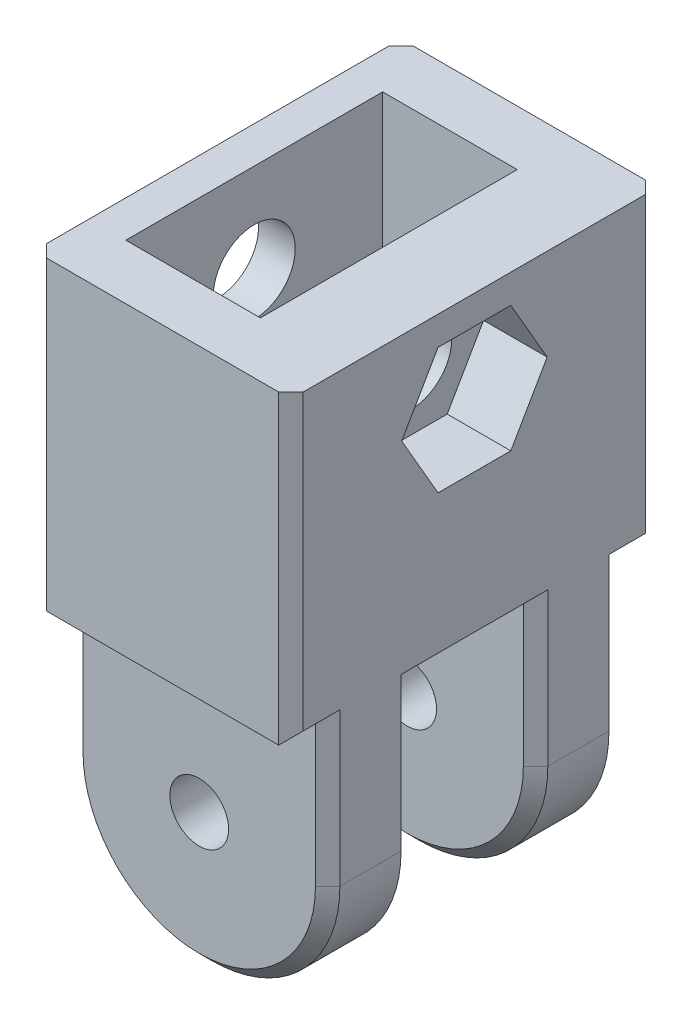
ISO-10303-21;
HEADER;
FILE_DESCRIPTION(('STEP AP214'),'2;1');
FILE_NAME('part.step','',(''),(''),'','','');
FILE_SCHEMA(('AUTOMOTIVE_DESIGN { 1 0 10303 214 1 1 1 1 }'));
ENDSEC;
DATA;
#1=APPLICATION_CONTEXT('core data for automotive mechanical design processes');
#2=APPLICATION_PROTOCOL_DEFINITION('international standard','automotive_design',2000,#1);
#3=PRODUCT_CONTEXT('',#1,'mechanical');
#4=PRODUCT('Part','Part','',(#3));
#5=PRODUCT_RELATED_PRODUCT_CATEGORY('part','',(#4));
#6=PRODUCT_DEFINITION_FORMATION('','',#4);
#7=PRODUCT_DEFINITION_CONTEXT('part definition',#1,'design');
#8=PRODUCT_DEFINITION('design','',#6,#7);
#9=PRODUCT_DEFINITION_SHAPE('','',#8);
#10=(LENGTH_UNIT() NAMED_UNIT(*) SI_UNIT(.MILLI.,.METRE.));
#11=(NAMED_UNIT(*) PLANE_ANGLE_UNIT() SI_UNIT($,.RADIAN.));
#12=(NAMED_UNIT(*) SI_UNIT($,.STERADIAN.) SOLID_ANGLE_UNIT());
#13=UNCERTAINTY_MEASURE_WITH_UNIT(LENGTH_MEASURE(1.E-05),#10,'distance_accuracy_value','');
#14=(GEOMETRIC_REPRESENTATION_CONTEXT(3) GLOBAL_UNCERTAINTY_ASSIGNED_CONTEXT((#13)) GLOBAL_UNIT_ASSIGNED_CONTEXT((#10,
#11,#12)) REPRESENTATION_CONTEXT('',''));
#15=CARTESIAN_POINT('',(0.,0.,0.));
#16=DIRECTION('',(0.,0.,1.));
#17=DIRECTION('',(1.,0.,0.));
#18=AXIS2_PLACEMENT_3D('',#15,#16,#17);
#19=CARTESIAN_POINT('',(-21.,0.,15.));
#20=DIRECTION('',(0.,1.,0.));
#21=DIRECTION('',(-1.,0.,0.));
#22=AXIS2_PLACEMENT_3D('',#19,#20,#21);
#23=PLANE('',#22);
#24=DIRECTION('',(1.,0.,0.));
#25=VECTOR('',#24,1.);
#26=CARTESIAN_POINT('',(-21.,0.,-12.));
#27=LINE('',#26,#25);
#28=CARTESIAN_POINT('',(-20.,0.,-12.));
#29=VERTEX_POINT('',#28);
#30=CARTESIAN_POINT('',(-1.00000000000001,0.,-12.));
#31=VERTEX_POINT('',#30);
#32=EDGE_CURVE('E641',#29,#31,#27,.T.);
#33=ORIENTED_EDGE('',*,*,#32,.F.);
#34=DIRECTION('',(0.,0.,-1.));
#35=VECTOR('',#34,1.);
#36=CARTESIAN_POINT('',(-20.,0.,15.));
#37=LINE('',#36,#35);
#38=CARTESIAN_POINT('',(-20.,0.,-15.));
#39=VERTEX_POINT('',#38);
#40=EDGE_CURVE('E453',#29,#39,#37,.T.);
#41=ORIENTED_EDGE('',*,*,#40,.T.);
#42=DIRECTION('',(1.,0.,0.));
#43=VECTOR('',#42,1.);
#44=CARTESIAN_POINT('',(-21.,0.,-15.));
#45=LINE('',#44,#43);
#46=CARTESIAN_POINT('',(-1.00000000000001,0.,-15.));
#47=VERTEX_POINT('',#46);
#48=EDGE_CURVE('E376',#39,#47,#45,.T.);
#49=ORIENTED_EDGE('',*,*,#48,.T.);
#50=DIRECTION('',(0.,0.,1.));
#51=VECTOR('',#50,1.);
#52=CARTESIAN_POINT('',(-1.00000000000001,0.,15.));
#53=LINE('',#52,#51);
#54=EDGE_CURVE('E451',#47,#31,#53,.T.);
#55=ORIENTED_EDGE('',*,*,#54,.T.);
#56=EDGE_LOOP('',(#33,#41,#49,#55));
#57=FACE_BOUND('',#56,.T.);
#58=ADVANCED_FACE('F36',(#57),#23,.F.);
#59=DIRECTION('',(1.,0.,0.));
#60=VECTOR('',#59,1.);
#61=CARTESIAN_POINT('',(-21.,0.,5.));
#62=LINE('',#61,#60);
#63=CARTESIAN_POINT('',(-20.,0.,5.));
#64=VERTEX_POINT('',#63);
#65=CARTESIAN_POINT('',(-1.,0.,5.));
#66=VERTEX_POINT('',#65);
#67=EDGE_CURVE('E634',#64,#66,#62,.T.);
#68=ORIENTED_EDGE('',*,*,#67,.F.);
#69=DIRECTION('',(0.,0.,-1.));
#70=VECTOR('',#69,1.);
#71=CARTESIAN_POINT('',(-20.,0.,15.));
#72=LINE('',#71,#70);
#73=CARTESIAN_POINT('',(-20.,0.,-5.));
#74=VERTEX_POINT('',#73);
#75=EDGE_CURVE('E429',#64,#74,#72,.T.);
#76=ORIENTED_EDGE('',*,*,#75,.T.);
#77=DIRECTION('',(-1.,0.,0.));
#78=VECTOR('',#77,1.);
#79=CARTESIAN_POINT('',(-21.,0.,-5.));
#80=LINE('',#79,#78);
#81=CARTESIAN_POINT('',(-1.,0.,-5.));
#82=VERTEX_POINT('',#81);
#83=EDGE_CURVE('E636',#82,#74,#80,.T.);
#84=ORIENTED_EDGE('',*,*,#83,.F.);
#85=DIRECTION('',(0.,0.,1.));
#86=VECTOR('',#85,1.);
#87=CARTESIAN_POINT('',(-1.,0.,15.));
#88=LINE('',#87,#86);
#89=EDGE_CURVE('E421',#82,#66,#88,.T.);
#90=ORIENTED_EDGE('',*,*,#89,.T.);
#91=EDGE_LOOP('',(#68,#76,#84,#90));
#92=FACE_BOUND('',#91,.T.);
#93=ADVANCED_FACE('F674',(#92),#23,.F.);
#94=DIRECTION('',(1.,0.,0.));
#95=VECTOR('',#94,1.);
#96=CARTESIAN_POINT('',(-21.,0.,15.));
#97=LINE('',#96,#95);
#98=CARTESIAN_POINT('',(-20.,0.,15.));
#99=VERTEX_POINT('',#98);
#100=CARTESIAN_POINT('',(-1.,0.,15.));
#101=VERTEX_POINT('',#100);
#102=EDGE_CURVE('E383',#99,#101,#97,.T.);
#103=ORIENTED_EDGE('',*,*,#102,.F.);
#104=DIRECTION('',(0.,0.,-1.));
#105=VECTOR('',#104,1.);
#106=CARTESIAN_POINT('',(-20.,0.,15.));
#107=LINE('',#106,#105);
#108=CARTESIAN_POINT('',(-20.,0.,12.));
#109=VERTEX_POINT('',#108);
#110=EDGE_CURVE('E470',#99,#109,#107,.T.);
#111=ORIENTED_EDGE('',*,*,#110,.T.);
#112=DIRECTION('',(-1.,0.,0.));
#113=VECTOR('',#112,1.);
#114=CARTESIAN_POINT('',(-21.,0.,12.));
#115=LINE('',#114,#113);
#116=CARTESIAN_POINT('',(-1.,0.,12.));
#117=VERTEX_POINT('',#116);
#118=EDGE_CURVE('E312',#117,#109,#115,.T.);
#119=ORIENTED_EDGE('',*,*,#118,.F.);
#120=DIRECTION('',(0.,0.,1.));
#121=VECTOR('',#120,1.);
#122=CARTESIAN_POINT('',(-1.,0.,15.));
#123=LINE('',#122,#121);
#124=EDGE_CURVE('E468',#117,#101,#123,.T.);
#125=ORIENTED_EDGE('',*,*,#124,.T.);
#126=EDGE_LOOP('',(#103,#111,#119,#125));
#127=FACE_BOUND('',#126,.T.);
#128=ADVANCED_FACE('F632',(#127),#23,.F.);
#129=CARTESIAN_POINT('',(0.,17.5,0.));
#130=DIRECTION('',(-1.,0.,0.));
#131=DIRECTION('',(0.,-1.,0.));
#132=AXIS2_PLACEMENT_3D('',#129,#130,#131);
#133=CYLINDRICAL_SURFACE('',#132,3.35);
#134=CARTESIAN_POINT('',(-7.,17.5,0.));
#135=DIRECTION('',(1.,0.,0.));
#136=DIRECTION('',(0.,0.,-1.));
#137=AXIS2_PLACEMENT_3D('',#134,#135,#136);
#138=CIRCLE('',#137,3.35);
#139=CARTESIAN_POINT('',(-7.,17.5,-3.35));
#140=VERTEX_POINT('',#139);
#141=EDGE_CURVE('E347',#140,#140,#138,.T.);
#142=ORIENTED_EDGE('',*,*,#141,.F.);
#143=EDGE_LOOP('',(#142));
#144=FACE_BOUND('',#143,.T.);
#145=CARTESIAN_POINT('',(-5.2,17.5,0.));
#146=DIRECTION('',(1.,0.,0.));
#147=DIRECTION('',(0.,0.,-1.));
#148=AXIS2_PLACEMENT_3D('',#145,#146,#147);
#149=CIRCLE('',#148,3.35);
#150=CARTESIAN_POINT('',(-5.2,17.5,-3.35));
#151=VERTEX_POINT('',#150);
#152=EDGE_CURVE('E335',#151,#151,#149,.F.);
#153=ORIENTED_EDGE('',*,*,#152,.F.);
#154=EDGE_LOOP('',(#153));
#155=FACE_BOUND('',#154,.T.);
#156=ADVANCED_FACE('F685',(#144,#155),#133,.F.);
#157=CARTESIAN_POINT('',(-21.,25.,15.));
#158=DIRECTION('',(1.,0.,0.));
#159=DIRECTION('',(0.,1.,0.));
#160=AXIS2_PLACEMENT_3D('',#157,#158,#159);
#161=PLANE('',#160);
#162=CARTESIAN_POINT('',(-21.,17.5,0.));
#163=DIRECTION('',(1.,0.,0.));
#164=DIRECTION('',(0.,1.,0.));
#165=AXIS2_PLACEMENT_3D('',#162,#163,#164);
#166=CIRCLE('',#165,3.35);
#167=CARTESIAN_POINT('',(-21.,20.85,0.));
#168=VERTEX_POINT('',#167);
#169=EDGE_CURVE('E346',#168,#168,#166,.T.);
#170=ORIENTED_EDGE('',*,*,#169,.T.);
#171=EDGE_LOOP('',(#170));
#172=FACE_BOUND('',#171,.T.);
#173=DIRECTION('',(0.,0.,-1.));
#174=VECTOR('',#173,1.);
#175=CARTESIAN_POINT('',(-21.,-11.5,15.));
#176=LINE('',#175,#174);
#177=CARTESIAN_POINT('',(-21.,-11.5,-11.));
#178=VERTEX_POINT('',#177);
#179=CARTESIAN_POINT('',(-21.,-11.5,-5.99999999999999));
#180=VERTEX_POINT('',#179);
#181=EDGE_CURVE('E412',#178,#180,#176,.F.);
#182=ORIENTED_EDGE('',*,*,#181,.T.);
#183=DIRECTION('',(0.,1.,0.));
#184=VECTOR('',#183,1.);
#185=CARTESIAN_POINT('',(-21.,25.,-5.99999999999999));
#186=LINE('',#185,#184);
#187=CARTESIAN_POINT('',(-21.,1.,-5.99999999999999));
#188=VERTEX_POINT('',#187);
#189=EDGE_CURVE('E449',#180,#188,#186,.T.);
#190=ORIENTED_EDGE('',*,*,#189,.T.);
#191=DIRECTION('',(0.,0.,1.));
#192=VECTOR('',#191,1.);
#193=CARTESIAN_POINT('',(-21.,1.,15.));
#194=LINE('',#193,#192);
#195=CARTESIAN_POINT('',(-21.,1.,5.99999999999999));
#196=VERTEX_POINT('',#195);
#197=EDGE_CURVE('E446',#188,#196,#194,.T.);
#198=ORIENTED_EDGE('',*,*,#197,.T.);
#199=DIRECTION('',(0.,-1.,0.));
#200=VECTOR('',#199,1.);
#201=CARTESIAN_POINT('',(-21.,25.,5.99999999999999));
#202=LINE('',#201,#200);
#203=CARTESIAN_POINT('',(-21.,-11.5,6.));
#204=VERTEX_POINT('',#203);
#205=EDGE_CURVE('E444',#196,#204,#202,.T.);
#206=ORIENTED_EDGE('',*,*,#205,.T.);
#207=DIRECTION('',(0.,0.,-1.));
#208=VECTOR('',#207,1.);
#209=CARTESIAN_POINT('',(-21.,-11.5,12.));
#210=LINE('',#209,#208);
#211=CARTESIAN_POINT('',(-21.,-11.5,11.));
#212=VERTEX_POINT('',#211);
#213=EDGE_CURVE('E400',#204,#212,#210,.F.);
#214=ORIENTED_EDGE('',*,*,#213,.T.);
#215=DIRECTION('',(0.,1.,0.));
#216=VECTOR('',#215,1.);
#217=CARTESIAN_POINT('',(-21.,25.,11.));
#218=LINE('',#217,#216);
#219=CARTESIAN_POINT('',(-21.,1.,11.));
#220=VERTEX_POINT('',#219);
#221=EDGE_CURVE('E432',#212,#220,#218,.T.);
#222=ORIENTED_EDGE('',*,*,#221,.T.);
#223=DIRECTION('',(0.,0.,1.));
#224=VECTOR('',#223,1.);
#225=CARTESIAN_POINT('',(-21.,1.,15.));
#226=LINE('',#225,#224);
#227=CARTESIAN_POINT('',(-21.,1.,14.));
#228=VERTEX_POINT('',#227);
#229=EDGE_CURVE('E434',#220,#228,#226,.T.);
#230=ORIENTED_EDGE('',*,*,#229,.T.);
#231=DIRECTION('',(0.,1.,0.));
#232=VECTOR('',#231,1.);
#233=CARTESIAN_POINT('',(-21.,25.,14.));
#234=LINE('',#233,#232);
#235=CARTESIAN_POINT('',(-21.,25.,14.));
#236=VERTEX_POINT('',#235);
#237=EDGE_CURVE('E436',#228,#236,#234,.T.);
#238=ORIENTED_EDGE('',*,*,#237,.T.);
#239=DIRECTION('',(0.,0.,-1.));
#240=VECTOR('',#239,1.);
#241=CARTESIAN_POINT('',(-21.,25.,15.));
#242=LINE('',#241,#240);
#243=CARTESIAN_POINT('',(-21.,25.,-14.));
#244=VERTEX_POINT('',#243);
#245=EDGE_CURVE('E390',#236,#244,#242,.T.);
#246=ORIENTED_EDGE('',*,*,#245,.T.);
#247=DIRECTION('',(0.,-1.,0.));
#248=VECTOR('',#247,1.);
#249=CARTESIAN_POINT('',(-21.,25.,-14.));
#250=LINE('',#249,#248);
#251=CARTESIAN_POINT('',(-21.,1.,-14.));
#252=VERTEX_POINT('',#251);
#253=EDGE_CURVE('E442',#244,#252,#250,.T.);
#254=ORIENTED_EDGE('',*,*,#253,.T.);
#255=DIRECTION('',(0.,0.,1.));
#256=VECTOR('',#255,1.);
#257=CARTESIAN_POINT('',(-21.,1.,15.));
#258=LINE('',#257,#256);
#259=CARTESIAN_POINT('',(-21.,1.,-11.));
#260=VERTEX_POINT('',#259);
#261=EDGE_CURVE('E440',#252,#260,#258,.T.);
#262=ORIENTED_EDGE('',*,*,#261,.T.);
#263=DIRECTION('',(0.,-1.,0.));
#264=VECTOR('',#263,1.);
#265=CARTESIAN_POINT('',(-21.,25.,-11.));
#266=LINE('',#265,#264);
#267=EDGE_CURVE('E438',#260,#178,#266,.T.);
#268=ORIENTED_EDGE('',*,*,#267,.T.);
#269=EDGE_LOOP('',(#182,#190,#198,#206,#214,#222,#230,#238,#246,#254,#262,#268));
#270=FACE_BOUND('',#269,.T.);
#271=ADVANCED_FACE('F689',(#172,#270),#161,.F.);
#272=CARTESIAN_POINT('',(0.,25.,15.));
#273=DIRECTION('',(-1.,0.,0.));
#274=DIRECTION('',(0.,0.,1.));
#275=AXIS2_PLACEMENT_3D('',#272,#273,#274);
#276=PLANE('',#275);
#277=DIRECTION('',(0.,0.,1.));
#278=VECTOR('',#277,1.);
#279=CARTESIAN_POINT('',(0.,22.65,-2.97335388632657));
#280=LINE('',#279,#278);
#281=CARTESIAN_POINT('',(0.,22.65,-2.97335388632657));
#282=VERTEX_POINT('',#281);
#283=CARTESIAN_POINT('',(0.,22.65,2.97335388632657));
#284=VERTEX_POINT('',#283);
#285=EDGE_CURVE('E323',#282,#284,#280,.T.);
#286=ORIENTED_EDGE('',*,*,#285,.F.);
#287=DIRECTION('',(0.,0.866025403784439,0.5));
#288=VECTOR('',#287,1.);
#289=CARTESIAN_POINT('',(0.,17.5,-5.94670777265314));
#290=LINE('',#289,#288);
#291=CARTESIAN_POINT('',(0.,17.5,-5.94670777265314));
#292=VERTEX_POINT('',#291);
#293=EDGE_CURVE('E287',#292,#282,#290,.T.);
#294=ORIENTED_EDGE('',*,*,#293,.F.);
#295=DIRECTION('',(0.,0.866025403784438,-0.5));
#296=VECTOR('',#295,1.);
#297=CARTESIAN_POINT('',(0.,12.35,-2.97335388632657));
#298=LINE('',#297,#296);
#299=CARTESIAN_POINT('',(0.,12.35,-2.97335388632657));
#300=VERTEX_POINT('',#299);
#301=EDGE_CURVE('E306',#300,#292,#298,.T.);
#302=ORIENTED_EDGE('',*,*,#301,.F.);
#303=DIRECTION('',(0.,0.,-1.));
#304=VECTOR('',#303,1.);
#305=CARTESIAN_POINT('',(0.,12.35,2.97335388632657));
#306=LINE('',#305,#304);
#307=CARTESIAN_POINT('',(0.,12.35,2.97335388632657));
#308=VERTEX_POINT('',#307);
#309=EDGE_CURVE('E309',#308,#300,#306,.T.);
#310=ORIENTED_EDGE('',*,*,#309,.F.);
#311=DIRECTION('',(0.,-0.866025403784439,-0.5));
#312=VECTOR('',#311,1.);
#313=CARTESIAN_POINT('',(0.,17.5,5.94670777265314));
#314=LINE('',#313,#312);
#315=CARTESIAN_POINT('',(0.,17.5,5.94670777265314));
#316=VERTEX_POINT('',#315);
#317=EDGE_CURVE('E328',#316,#308,#314,.T.);
#318=ORIENTED_EDGE('',*,*,#317,.F.);
#319=DIRECTION('',(0.,-0.866025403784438,0.5));
#320=VECTOR('',#319,1.);
#321=CARTESIAN_POINT('',(0.,22.65,2.97335388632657));
#322=LINE('',#321,#320);
#323=EDGE_CURVE('E325',#284,#316,#322,.T.);
#324=ORIENTED_EDGE('',*,*,#323,.F.);
#325=EDGE_LOOP('',(#286,#294,#302,#310,#318,#324));
#326=FACE_BOUND('',#325,.T.);
#327=DIRECTION('',(0.,0.,-1.));
#328=VECTOR('',#327,1.);
#329=CARTESIAN_POINT('',(0.,0.999999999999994,15.));
#330=LINE('',#329,#328);
#331=CARTESIAN_POINT('',(0.,0.999999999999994,6.));
#332=VERTEX_POINT('',#331);
#333=CARTESIAN_POINT('',(0.,0.999999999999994,-6.));
#334=VERTEX_POINT('',#333);
#335=EDGE_CURVE('E523',#332,#334,#330,.T.);
#336=ORIENTED_EDGE('',*,*,#335,.T.);
#337=DIRECTION('',(0.,-1.,0.));
#338=VECTOR('',#337,1.);
#339=CARTESIAN_POINT('',(0.,25.,-6.));
#340=LINE('',#339,#338);
#341=CARTESIAN_POINT('',(0.,-11.5,-6.));
#342=VERTEX_POINT('',#341);
#343=EDGE_CURVE('E525',#334,#342,#340,.T.);
#344=ORIENTED_EDGE('',*,*,#343,.T.);
#345=DIRECTION('',(0.,0.,1.));
#346=VECTOR('',#345,1.);
#347=CARTESIAN_POINT('',(0.,-11.5,15.));
#348=LINE('',#347,#346);
#349=CARTESIAN_POINT('',(0.,-11.5,-11.));
#350=VERTEX_POINT('',#349);
#351=EDGE_CURVE('E418',#342,#350,#348,.F.);
#352=ORIENTED_EDGE('',*,*,#351,.T.);
#353=DIRECTION('',(0.,1.,0.));
#354=VECTOR('',#353,1.);
#355=CARTESIAN_POINT('',(0.,25.,-11.));
#356=LINE('',#355,#354);
#357=CARTESIAN_POINT('',(0.,1.,-11.));
#358=VERTEX_POINT('',#357);
#359=EDGE_CURVE('E519',#350,#358,#356,.T.);
#360=ORIENTED_EDGE('',*,*,#359,.T.);
#361=DIRECTION('',(0.,0.,-1.));
#362=VECTOR('',#361,1.);
#363=CARTESIAN_POINT('',(0.,1.,15.));
#364=LINE('',#363,#362);
#365=CARTESIAN_POINT('',(0.,1.,-14.));
#366=VERTEX_POINT('',#365);
#367=EDGE_CURVE('E517',#358,#366,#364,.T.);
#368=ORIENTED_EDGE('',*,*,#367,.T.);
#369=DIRECTION('',(0.,1.,0.));
#370=VECTOR('',#369,1.);
#371=CARTESIAN_POINT('',(0.,25.,-14.));
#372=LINE('',#371,#370);
#373=CARTESIAN_POINT('',(0.,25.,-14.));
#374=VERTEX_POINT('',#373);
#375=EDGE_CURVE('E515',#366,#374,#372,.T.);
#376=ORIENTED_EDGE('',*,*,#375,.T.);
#377=DIRECTION('',(0.,0.,-1.));
#378=VECTOR('',#377,1.);
#379=CARTESIAN_POINT('',(0.,25.,15.));
#380=LINE('',#379,#378);
#381=CARTESIAN_POINT('',(0.,25.,14.));
#382=VERTEX_POINT('',#381);
#383=EDGE_CURVE('E397',#382,#374,#380,.T.);
#384=ORIENTED_EDGE('',*,*,#383,.F.);
#385=DIRECTION('',(0.,-1.,0.));
#386=VECTOR('',#385,1.);
#387=CARTESIAN_POINT('',(0.,0.,14.));
#388=LINE('',#387,#386);
#389=CARTESIAN_POINT('',(0.,1.00000000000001,14.));
#390=VERTEX_POINT('',#389);
#391=EDGE_CURVE('E509',#382,#390,#388,.T.);
#392=ORIENTED_EDGE('',*,*,#391,.T.);
#393=DIRECTION('',(0.,0.,-1.));
#394=VECTOR('',#393,1.);
#395=CARTESIAN_POINT('',(0.,1.00000000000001,15.));
#396=LINE('',#395,#394);
#397=CARTESIAN_POINT('',(0.,1.00000000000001,11.));
#398=VERTEX_POINT('',#397);
#399=EDGE_CURVE('E511',#390,#398,#396,.T.);
#400=ORIENTED_EDGE('',*,*,#399,.T.);
#401=DIRECTION('',(0.,-1.,0.));
#402=VECTOR('',#401,1.);
#403=CARTESIAN_POINT('',(0.,25.,11.));
#404=LINE('',#403,#402);
#405=CARTESIAN_POINT('',(0.,-11.5,11.));
#406=VERTEX_POINT('',#405);
#407=EDGE_CURVE('E513',#398,#406,#404,.T.);
#408=ORIENTED_EDGE('',*,*,#407,.T.);
#409=DIRECTION('',(0.,0.,1.));
#410=VECTOR('',#409,1.);
#411=CARTESIAN_POINT('',(0.,-11.5,5.));
#412=LINE('',#411,#410);
#413=CARTESIAN_POINT('',(0.,-11.5,6.));
#414=VERTEX_POINT('',#413);
#415=EDGE_CURVE('E415',#406,#414,#412,.F.);
#416=ORIENTED_EDGE('',*,*,#415,.T.);
#417=DIRECTION('',(0.,1.,0.));
#418=VECTOR('',#417,1.);
#419=CARTESIAN_POINT('',(0.,25.,6.));
#420=LINE('',#419,#418);
#421=EDGE_CURVE('E521',#414,#332,#420,.T.);
#422=ORIENTED_EDGE('',*,*,#421,.T.);
#423=EDGE_LOOP('',(#336,#344,#352,#360,#368,#376,#384,#392,#400,#408,#416,#422));
#424=FACE_BOUND('',#423,.T.);
#425=ADVANCED_FACE('F696',(#326,#424),#276,.F.);
#426=CARTESIAN_POINT('',(-21.,25.,15.));
#427=DIRECTION('',(0.,-1.,0.));
#428=DIRECTION('',(1.,0.,0.));
#429=AXIS2_PLACEMENT_3D('',#426,#427,#428);
#430=PLANE('',#429);
#431=DIRECTION('',(1.,0.,0.));
#432=VECTOR('',#431,1.);
#433=CARTESIAN_POINT('',(-18.,25.,10.5));
#434=LINE('',#433,#432);
#435=CARTESIAN_POINT('',(-18.,25.,10.5));
#436=VERTEX_POINT('',#435);
#437=CARTESIAN_POINT('',(-7.,25.,10.5));
#438=VERTEX_POINT('',#437);
#439=EDGE_CURVE('E366',#436,#438,#434,.T.);
#440=ORIENTED_EDGE('',*,*,#439,.F.);
#441=DIRECTION('',(0.,0.,1.));
#442=VECTOR('',#441,1.);
#443=CARTESIAN_POINT('',(-18.,25.,-10.5));
#444=LINE('',#443,#442);
#445=CARTESIAN_POINT('',(-18.,25.,-10.5));
#446=VERTEX_POINT('',#445);
#447=EDGE_CURVE('E350',#446,#436,#444,.T.);
#448=ORIENTED_EDGE('',*,*,#447,.F.);
#449=DIRECTION('',(-1.,0.,0.));
#450=VECTOR('',#449,1.);
#451=CARTESIAN_POINT('',(-18.,25.,-10.5));
#452=LINE('',#451,#450);
#453=CARTESIAN_POINT('',(-7.,25.,-10.5));
#454=VERTEX_POINT('',#453);
#455=EDGE_CURVE('E355',#454,#446,#452,.T.);
#456=ORIENTED_EDGE('',*,*,#455,.F.);
#457=DIRECTION('',(0.,0.,-1.));
#458=VECTOR('',#457,1.);
#459=CARTESIAN_POINT('',(-7.,25.,-10.5));
#460=LINE('',#459,#458);
#461=EDGE_CURVE('E369',#438,#454,#460,.T.);
#462=ORIENTED_EDGE('',*,*,#461,.F.);
#463=EDGE_LOOP('',(#440,#448,#456,#462));
#464=FACE_BOUND('',#463,.T.);
#465=DIRECTION('',(-1.,0.,0.));
#466=VECTOR('',#465,1.);
#467=CARTESIAN_POINT('',(-21.,25.,-15.));
#468=LINE('',#467,#466);
#469=CARTESIAN_POINT('',(-1.00000000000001,25.,-15.));
#470=VERTEX_POINT('',#469);
#471=CARTESIAN_POINT('',(-20.,25.,-15.));
#472=VERTEX_POINT('',#471);
#473=EDGE_CURVE('E387',#470,#472,#468,.T.);
#474=ORIENTED_EDGE('',*,*,#473,.T.);
#475=DIRECTION('',(0.707106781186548,0.,-0.707106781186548));
#476=VECTOR('',#475,1.);
#477=CARTESIAN_POINT('',(-21.,25.,-14.));
#478=LINE('',#477,#476);
#479=EDGE_CURVE('E466',#472,#244,#478,.F.);
#480=ORIENTED_EDGE('',*,*,#479,.T.);
#481=ORIENTED_EDGE('',*,*,#245,.F.);
#482=DIRECTION('',(0.707106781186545,0.,0.70710678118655));
#483=VECTOR('',#482,1.);
#484=CARTESIAN_POINT('',(-20.,25.,15.));
#485=LINE('',#484,#483);
#486=CARTESIAN_POINT('',(-20.,25.,15.));
#487=VERTEX_POINT('',#486);
#488=EDGE_CURVE('E464',#236,#487,#485,.T.);
#489=ORIENTED_EDGE('',*,*,#488,.T.);
#490=DIRECTION('',(-1.,0.,0.));
#491=VECTOR('',#490,1.);
#492=CARTESIAN_POINT('',(-21.,25.,15.));
#493=LINE('',#492,#491);
#494=CARTESIAN_POINT('',(-1.,25.,15.));
#495=VERTEX_POINT('',#494);
#496=EDGE_CURVE('E386',#495,#487,#493,.T.);
#497=ORIENTED_EDGE('',*,*,#496,.F.);
#498=DIRECTION('',(0.707106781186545,0.,-0.70710678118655));
#499=VECTOR('',#498,1.);
#500=CARTESIAN_POINT('',(-1.00000000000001,25.,15.));
#501=LINE('',#500,#499);
#502=EDGE_CURVE('E460',#495,#382,#501,.T.);
#503=ORIENTED_EDGE('',*,*,#502,.T.);
#504=ORIENTED_EDGE('',*,*,#383,.T.);
#505=DIRECTION('',(0.70710678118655,0.,0.707106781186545));
#506=VECTOR('',#505,1.);
#507=CARTESIAN_POINT('',(0.,25.,-14.));
#508=LINE('',#507,#506);
#509=EDGE_CURVE('E462',#374,#470,#508,.F.);
#510=ORIENTED_EDGE('',*,*,#509,.T.);
#511=EDGE_LOOP('',(#474,#480,#481,#489,#497,#503,#504,#510));
#512=FACE_BOUND('',#511,.T.);
#513=ADVANCED_FACE('F622',(#464,#512),#430,.F.);
#514=CARTESIAN_POINT('',(0.,0.,15.));
#515=DIRECTION('',(0.,0.,1.));
#516=DIRECTION('',(1.,0.,0.));
#517=AXIS2_PLACEMENT_3D('',#514,#515,#516);
#518=PLANE('',#517);
#519=ORIENTED_EDGE('',*,*,#496,.T.);
#520=DIRECTION('',(0.,-1.,0.));
#521=VECTOR('',#520,1.);
#522=CARTESIAN_POINT('',(-20.,0.,15.));
#523=LINE('',#522,#521);
#524=EDGE_CURVE('E475',#487,#99,#523,.T.);
#525=ORIENTED_EDGE('',*,*,#524,.T.);
#526=ORIENTED_EDGE('',*,*,#102,.T.);
#527=DIRECTION('',(0.,1.,0.));
#528=VECTOR('',#527,1.);
#529=CARTESIAN_POINT('',(-1.,25.,15.));
#530=LINE('',#529,#528);
#531=EDGE_CURVE('E473',#101,#495,#530,.T.);
#532=ORIENTED_EDGE('',*,*,#531,.T.);
#533=EDGE_LOOP('',(#519,#525,#526,#532));
#534=FACE_BOUND('',#533,.T.);
#535=ADVANCED_FACE('F618',(#534),#518,.T.);
#536=CARTESIAN_POINT('',(0.,0.,-15.));
#537=DIRECTION('',(0.,0.,1.));
#538=DIRECTION('',(1.,0.,0.));
#539=AXIS2_PLACEMENT_3D('',#536,#537,#538);
#540=PLANE('',#539);
#541=ORIENTED_EDGE('',*,*,#48,.F.);
#542=DIRECTION('',(0.,1.,0.));
#543=VECTOR('',#542,1.);
#544=CARTESIAN_POINT('',(-20.,0.,-15.));
#545=LINE('',#544,#543);
#546=EDGE_CURVE('E458',#39,#472,#545,.T.);
#547=ORIENTED_EDGE('',*,*,#546,.T.);
#548=ORIENTED_EDGE('',*,*,#473,.F.);
#549=DIRECTION('',(0.,-1.,0.));
#550=VECTOR('',#549,1.);
#551=CARTESIAN_POINT('',(-1.00000000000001,0.,-15.));
#552=LINE('',#551,#550);
#553=EDGE_CURVE('E456',#470,#47,#552,.T.);
#554=ORIENTED_EDGE('',*,*,#553,.T.);
#555=EDGE_LOOP('',(#541,#547,#548,#554));
#556=FACE_BOUND('',#555,.T.);
#557=ADVANCED_FACE('F799',(#556),#540,.F.);
#558=CARTESIAN_POINT('',(-18.,6.50000000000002,-10.5));
#559=DIRECTION('',(-1.,0.,0.));
#560=DIRECTION('',(0.,0.,1.));
#561=AXIS2_PLACEMENT_3D('',#558,#559,#560);
#562=PLANE('',#561);
#563=CARTESIAN_POINT('',(-18.,17.5,0.));
#564=DIRECTION('',(-1.,0.,0.));
#565=DIRECTION('',(0.,0.,1.));
#566=AXIS2_PLACEMENT_3D('',#563,#564,#565);
#567=CIRCLE('',#566,3.35);
#568=CARTESIAN_POINT('',(-18.,17.5,3.35));
#569=VERTEX_POINT('',#568);
#570=EDGE_CURVE('E343',#569,#569,#567,.T.);
#571=ORIENTED_EDGE('',*,*,#570,.T.);
#572=EDGE_LOOP('',(#571));
#573=FACE_BOUND('',#572,.T.);
#574=ORIENTED_EDGE('',*,*,#447,.T.);
#575=DIRECTION('',(0.,1.,0.));
#576=VECTOR('',#575,1.);
#577=CARTESIAN_POINT('',(-18.,6.50000000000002,10.5));
#578=LINE('',#577,#576);
#579=CARTESIAN_POINT('',(-18.,6.50000000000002,10.5));
#580=VERTEX_POINT('',#579);
#581=EDGE_CURVE('E364',#580,#436,#578,.T.);
#582=ORIENTED_EDGE('',*,*,#581,.F.);
#583=DIRECTION('',(0.,0.,1.));
#584=VECTOR('',#583,1.);
#585=CARTESIAN_POINT('',(-18.,6.50000000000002,-10.5));
#586=LINE('',#585,#584);
#587=CARTESIAN_POINT('',(-18.,6.50000000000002,-10.5));
#588=VERTEX_POINT('',#587);
#589=EDGE_CURVE('E351',#588,#580,#586,.T.);
#590=ORIENTED_EDGE('',*,*,#589,.F.);
#591=DIRECTION('',(0.,1.,0.));
#592=VECTOR('',#591,1.);
#593=CARTESIAN_POINT('',(-18.,6.50000000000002,-10.5));
#594=LINE('',#593,#592);
#595=EDGE_CURVE('E374',#588,#446,#594,.T.);
#596=ORIENTED_EDGE('',*,*,#595,.T.);
#597=EDGE_LOOP('',(#574,#582,#590,#596));
#598=FACE_BOUND('',#597,.T.);
#599=ADVANCED_FACE('F1219',(#573,#598),#562,.F.);
#600=CARTESIAN_POINT('',(-18.,6.50000000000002,-10.5));
#601=DIRECTION('',(0.,0.,-1.));
#602=DIRECTION('',(-1.,0.,0.));
#603=AXIS2_PLACEMENT_3D('',#600,#601,#602);
#604=PLANE('',#603);
#605=ORIENTED_EDGE('',*,*,#455,.T.);
#606=ORIENTED_EDGE('',*,*,#595,.F.);
#607=DIRECTION('',(-1.,0.,0.));
#608=VECTOR('',#607,1.);
#609=CARTESIAN_POINT('',(-18.,6.50000000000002,-10.5));
#610=LINE('',#609,#608);
#611=CARTESIAN_POINT('',(-7.,6.50000000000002,-10.5));
#612=VERTEX_POINT('',#611);
#613=EDGE_CURVE('E361',#612,#588,#610,.T.);
#614=ORIENTED_EDGE('',*,*,#613,.F.);
#615=DIRECTION('',(0.,1.,0.));
#616=VECTOR('',#615,1.);
#617=CARTESIAN_POINT('',(-7.,6.50000000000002,-10.5));
#618=LINE('',#617,#616);
#619=EDGE_CURVE('E377',#612,#454,#618,.T.);
#620=ORIENTED_EDGE('',*,*,#619,.T.);
#621=EDGE_LOOP('',(#605,#606,#614,#620));
#622=FACE_BOUND('',#621,.T.);
#623=ADVANCED_FACE('F1229',(#622),#604,.F.);
#624=CARTESIAN_POINT('',(-7.,6.50000000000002,-10.5));
#625=DIRECTION('',(1.,0.,0.));
#626=DIRECTION('',(0.,0.,-1.));
#627=AXIS2_PLACEMENT_3D('',#624,#625,#626);
#628=PLANE('',#627);
#629=ORIENTED_EDGE('',*,*,#141,.T.);
#630=EDGE_LOOP('',(#629));
#631=FACE_BOUND('',#630,.T.);
#632=ORIENTED_EDGE('',*,*,#461,.T.);
#633=ORIENTED_EDGE('',*,*,#619,.F.);
#634=DIRECTION('',(0.,0.,-1.));
#635=VECTOR('',#634,1.);
#636=CARTESIAN_POINT('',(-7.,6.50000000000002,-10.5));
#637=LINE('',#636,#635);
#638=CARTESIAN_POINT('',(-7.,6.50000000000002,10.5));
#639=VERTEX_POINT('',#638);
#640=EDGE_CURVE('E358',#639,#612,#637,.T.);
#641=ORIENTED_EDGE('',*,*,#640,.F.);
#642=DIRECTION('',(0.,1.,0.));
#643=VECTOR('',#642,1.);
#644=CARTESIAN_POINT('',(-7.,6.50000000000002,10.5));
#645=LINE('',#644,#643);
#646=EDGE_CURVE('E379',#639,#438,#645,.T.);
#647=ORIENTED_EDGE('',*,*,#646,.T.);
#648=EDGE_LOOP('',(#632,#633,#641,#647));
#649=FACE_BOUND('',#648,.T.);
#650=ADVANCED_FACE('F1238',(#631,#649),#628,.F.);
#651=CARTESIAN_POINT('',(-18.,6.50000000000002,10.5));
#652=DIRECTION('',(0.,0.,1.));
#653=DIRECTION('',(1.,0.,0.));
#654=AXIS2_PLACEMENT_3D('',#651,#652,#653);
#655=PLANE('',#654);
#656=ORIENTED_EDGE('',*,*,#439,.T.);
#657=ORIENTED_EDGE('',*,*,#646,.F.);
#658=DIRECTION('',(1.,0.,0.));
#659=VECTOR('',#658,1.);
#660=CARTESIAN_POINT('',(-18.,6.50000000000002,10.5));
#661=LINE('',#660,#659);
#662=EDGE_CURVE('E354',#580,#639,#661,.T.);
#663=ORIENTED_EDGE('',*,*,#662,.F.);
#664=ORIENTED_EDGE('',*,*,#581,.T.);
#665=EDGE_LOOP('',(#656,#657,#663,#664));
#666=FACE_BOUND('',#665,.T.);
#667=ADVANCED_FACE('F710',(#666),#655,.F.);
#668=CARTESIAN_POINT('',(0.,6.50000000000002,0.));
#669=DIRECTION('',(0.,1.,0.));
#670=DIRECTION('',(0.,0.,1.));
#671=AXIS2_PLACEMENT_3D('',#668,#669,#670);
#672=PLANE('',#671);
#673=ORIENTED_EDGE('',*,*,#589,.T.);
#674=ORIENTED_EDGE('',*,*,#662,.T.);
#675=ORIENTED_EDGE('',*,*,#640,.T.);
#676=ORIENTED_EDGE('',*,*,#613,.T.);
#677=EDGE_LOOP('',(#673,#674,#675,#676));
#678=FACE_BOUND('',#677,.T.);
#679=ADVANCED_FACE('F703',(#678),#672,.T.);
#680=ORIENTED_EDGE('',*,*,#570,.F.);
#681=EDGE_LOOP('',(#680));
#682=FACE_BOUND('',#681,.T.);
#683=ORIENTED_EDGE('',*,*,#169,.F.);
#684=EDGE_LOOP('',(#683));
#685=FACE_BOUND('',#684,.T.);
#686=ADVANCED_FACE('F692',(#682,#685),#133,.F.);
#687=CARTESIAN_POINT('',(-5.2,0.,0.));
#688=DIRECTION('',(1.,0.,0.));
#689=DIRECTION('',(0.,0.,-1.));
#690=AXIS2_PLACEMENT_3D('',#687,#688,#689);
#691=PLANE('',#690);
#692=DIRECTION('',(0.,0.866025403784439,0.5));
#693=VECTOR('',#692,1.);
#694=CARTESIAN_POINT('',(-5.2,17.5,-5.94670777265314));
#695=LINE('',#694,#693);
#696=CARTESIAN_POINT('',(-5.2,17.5,-5.94670777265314));
#697=VERTEX_POINT('',#696);
#698=CARTESIAN_POINT('',(-5.2,22.65,-2.97335388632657));
#699=VERTEX_POINT('',#698);
#700=EDGE_CURVE('E284',#697,#699,#695,.T.);
#701=ORIENTED_EDGE('',*,*,#700,.T.);
#702=DIRECTION('',(0.,0.,1.));
#703=VECTOR('',#702,1.);
#704=CARTESIAN_POINT('',(-5.2,22.65,-2.97335388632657));
#705=LINE('',#704,#703);
#706=CARTESIAN_POINT('',(-5.2,22.65,2.97335388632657));
#707=VERTEX_POINT('',#706);
#708=EDGE_CURVE('E295',#699,#707,#705,.T.);
#709=ORIENTED_EDGE('',*,*,#708,.T.);
#710=DIRECTION('',(0.,-0.866025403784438,0.5));
#711=VECTOR('',#710,1.);
#712=CARTESIAN_POINT('',(-5.2,22.65,2.97335388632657));
#713=LINE('',#712,#711);
#714=CARTESIAN_POINT('',(-5.2,17.5,5.94670777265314));
#715=VERTEX_POINT('',#714);
#716=EDGE_CURVE('E300',#707,#715,#713,.T.);
#717=ORIENTED_EDGE('',*,*,#716,.T.);
#718=DIRECTION('',(0.,-0.866025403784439,-0.5));
#719=VECTOR('',#718,1.);
#720=CARTESIAN_POINT('',(-5.2,17.5,5.94670777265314));
#721=LINE('',#720,#719);
#722=CARTESIAN_POINT('',(-5.2,12.35,2.97335388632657));
#723=VERTEX_POINT('',#722);
#724=EDGE_CURVE('E316',#715,#723,#721,.T.);
#725=ORIENTED_EDGE('',*,*,#724,.T.);
#726=DIRECTION('',(0.,0.,-1.));
#727=VECTOR('',#726,1.);
#728=CARTESIAN_POINT('',(-5.2,12.35,2.97335388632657));
#729=LINE('',#728,#727);
#730=CARTESIAN_POINT('',(-5.2,12.35,-2.97335388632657));
#731=VERTEX_POINT('',#730);
#732=EDGE_CURVE('E319',#723,#731,#729,.T.);
#733=ORIENTED_EDGE('',*,*,#732,.T.);
#734=DIRECTION('',(0.,0.866025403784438,-0.5));
#735=VECTOR('',#734,1.);
#736=CARTESIAN_POINT('',(-5.2,12.35,-2.97335388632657));
#737=LINE('',#736,#735);
#738=EDGE_CURVE('E292',#731,#697,#737,.T.);
#739=ORIENTED_EDGE('',*,*,#738,.T.);
#740=EDGE_LOOP('',(#701,#709,#717,#725,#733,#739));
#741=FACE_BOUND('',#740,.T.);
#742=ORIENTED_EDGE('',*,*,#152,.T.);
#743=EDGE_LOOP('',(#742));
#744=FACE_BOUND('',#743,.T.);
#745=ADVANCED_FACE('F302',(#741,#744),#691,.T.);
#746=CARTESIAN_POINT('',(-5.2,17.5,-5.94670777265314));
#747=DIRECTION('',(0.,0.5,-0.866025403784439));
#748=DIRECTION('',(0.,0.866025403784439,0.5));
#749=AXIS2_PLACEMENT_3D('',#746,#747,#748);
#750=PLANE('',#749);
#751=ORIENTED_EDGE('',*,*,#293,.T.);
#752=DIRECTION('',(1.,0.,0.));
#753=VECTOR('',#752,1.);
#754=CARTESIAN_POINT('',(-5.2,22.65,-2.97335388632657));
#755=LINE('',#754,#753);
#756=EDGE_CURVE('E280',#699,#282,#755,.T.);
#757=ORIENTED_EDGE('',*,*,#756,.F.);
#758=ORIENTED_EDGE('',*,*,#700,.F.);
#759=DIRECTION('',(1.,0.,0.));
#760=VECTOR('',#759,1.);
#761=CARTESIAN_POINT('',(-5.2,17.5,-5.94670777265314));
#762=LINE('',#761,#760);
#763=EDGE_CURVE('E333',#697,#292,#762,.T.);
#764=ORIENTED_EDGE('',*,*,#763,.T.);
#765=EDGE_LOOP('',(#751,#757,#758,#764));
#766=FACE_BOUND('',#765,.T.);
#767=ADVANCED_FACE('F282',(#766),#750,.F.);
#768=CARTESIAN_POINT('',(-5.2,12.35,-2.97335388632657));
#769=DIRECTION('',(0.,-0.5,-0.866025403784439));
#770=DIRECTION('',(0.,0.866025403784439,-0.5));
#771=AXIS2_PLACEMENT_3D('',#768,#769,#770);
#772=PLANE('',#771);
#773=ORIENTED_EDGE('',*,*,#301,.T.);
#774=ORIENTED_EDGE('',*,*,#763,.F.);
#775=ORIENTED_EDGE('',*,*,#738,.F.);
#776=DIRECTION('',(1.,0.,0.));
#777=VECTOR('',#776,1.);
#778=CARTESIAN_POINT('',(-5.2,12.35,-2.97335388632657));
#779=LINE('',#778,#777);
#780=EDGE_CURVE('E336',#731,#300,#779,.T.);
#781=ORIENTED_EDGE('',*,*,#780,.T.);
#782=EDGE_LOOP('',(#773,#774,#775,#781));
#783=FACE_BOUND('',#782,.T.);
#784=ADVANCED_FACE('F1281',(#783),#772,.F.);
#785=CARTESIAN_POINT('',(-5.2,12.35,2.97335388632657));
#786=DIRECTION('',(0.,-1.,0.));
#787=DIRECTION('',(0.,0.,-1.));
#788=AXIS2_PLACEMENT_3D('',#785,#786,#787);
#789=PLANE('',#788);
#790=ORIENTED_EDGE('',*,*,#309,.T.);
#791=ORIENTED_EDGE('',*,*,#780,.F.);
#792=ORIENTED_EDGE('',*,*,#732,.F.);
#793=DIRECTION('',(1.,0.,0.));
#794=VECTOR('',#793,1.);
#795=CARTESIAN_POINT('',(-5.2,12.35,2.97335388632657));
#796=LINE('',#795,#794);
#797=EDGE_CURVE('E338',#723,#308,#796,.T.);
#798=ORIENTED_EDGE('',*,*,#797,.T.);
#799=EDGE_LOOP('',(#790,#791,#792,#798));
#800=FACE_BOUND('',#799,.T.);
#801=ADVANCED_FACE('F1288',(#800),#789,.F.);
#802=CARTESIAN_POINT('',(-5.2,17.5,5.94670777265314));
#803=DIRECTION('',(0.,-0.5,0.866025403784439));
#804=DIRECTION('',(0.,-0.866025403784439,-0.5));
#805=AXIS2_PLACEMENT_3D('',#802,#803,#804);
#806=PLANE('',#805);
#807=ORIENTED_EDGE('',*,*,#317,.T.);
#808=ORIENTED_EDGE('',*,*,#797,.F.);
#809=ORIENTED_EDGE('',*,*,#724,.F.);
#810=DIRECTION('',(1.,0.,0.));
#811=VECTOR('',#810,1.);
#812=CARTESIAN_POINT('',(-5.2,17.5,5.94670777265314));
#813=LINE('',#812,#811);
#814=EDGE_CURVE('E340',#715,#316,#813,.T.);
#815=ORIENTED_EDGE('',*,*,#814,.T.);
#816=EDGE_LOOP('',(#807,#808,#809,#815));
#817=FACE_BOUND('',#816,.T.);
#818=ADVANCED_FACE('F1297',(#817),#806,.F.);
#819=CARTESIAN_POINT('',(-5.2,22.65,2.97335388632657));
#820=DIRECTION('',(0.,0.5,0.866025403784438));
#821=DIRECTION('',(0.,-0.866025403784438,0.5));
#822=AXIS2_PLACEMENT_3D('',#819,#820,#821);
#823=PLANE('',#822);
#824=ORIENTED_EDGE('',*,*,#323,.T.);
#825=ORIENTED_EDGE('',*,*,#814,.F.);
#826=ORIENTED_EDGE('',*,*,#716,.F.);
#827=DIRECTION('',(1.,0.,0.));
#828=VECTOR('',#827,1.);
#829=CARTESIAN_POINT('',(-5.2,22.65,2.97335388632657));
#830=LINE('',#829,#828);
#831=EDGE_CURVE('E291',#707,#284,#830,.T.);
#832=ORIENTED_EDGE('',*,*,#831,.T.);
#833=EDGE_LOOP('',(#824,#825,#826,#832));
#834=FACE_BOUND('',#833,.T.);
#835=ADVANCED_FACE('F1306',(#834),#823,.F.);
#836=CARTESIAN_POINT('',(-5.2,22.65,-2.97335388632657));
#837=DIRECTION('',(0.,1.,0.));
#838=DIRECTION('',(0.,0.,1.));
#839=AXIS2_PLACEMENT_3D('',#836,#837,#838);
#840=PLANE('',#839);
#841=ORIENTED_EDGE('',*,*,#285,.T.);
#842=ORIENTED_EDGE('',*,*,#831,.F.);
#843=ORIENTED_EDGE('',*,*,#708,.F.);
#844=ORIENTED_EDGE('',*,*,#756,.T.);
#845=EDGE_LOOP('',(#841,#842,#843,#844));
#846=FACE_BOUND('',#845,.T.);
#847=ADVANCED_FACE('F296',(#846),#840,.F.);
#848=CARTESIAN_POINT('',(-21.,-22.,5.));
#849=DIRECTION('',(0.,0.,1.));
#850=DIRECTION('',(1.,0.,0.));
#851=AXIS2_PLACEMENT_3D('',#848,#849,#850);
#852=PLANE('',#851);
#853=CARTESIAN_POINT('',(-10.5,-11.,5.));
#854=DIRECTION('',(0.,0.,1.));
#855=DIRECTION('',(1.,0.,0.));
#856=AXIS2_PLACEMENT_3D('',#853,#854,#855);
#857=CIRCLE('',#856,2.4);
#858=CARTESIAN_POINT('',(-8.1,-11.,5.));
#859=VERTEX_POINT('',#858);
#860=EDGE_CURVE('E646',#859,#859,#857,.T.);
#861=ORIENTED_EDGE('',*,*,#860,.T.);
#862=EDGE_LOOP('',(#861));
#863=FACE_BOUND('',#862,.T.);
#864=CARTESIAN_POINT('',(-10.5,-11.5,5.));
#865=DIRECTION('',(0.,0.,1.));
#866=DIRECTION('',(1.,0.,0.));
#867=AXIS2_PLACEMENT_3D('',#864,#865,#866);
#868=CIRCLE('',#867,9.5);
#869=CARTESIAN_POINT('',(-10.5,-21.,5.));
#870=VERTEX_POINT('',#869);
#871=CARTESIAN_POINT('',(-20.,-11.5,5.));
#872=VERTEX_POINT('',#871);
#873=EDGE_CURVE('E489',#870,#872,#868,.F.);
#874=ORIENTED_EDGE('',*,*,#873,.T.);
#875=DIRECTION('',(0.,1.,0.));
#876=VECTOR('',#875,1.);
#877=CARTESIAN_POINT('',(-20.,-22.,5.));
#878=LINE('',#877,#876);
#879=EDGE_CURVE('E491',#872,#64,#878,.T.);
#880=ORIENTED_EDGE('',*,*,#879,.T.);
#881=ORIENTED_EDGE('',*,*,#67,.T.);
#882=DIRECTION('',(0.,-1.,0.));
#883=VECTOR('',#882,1.);
#884=CARTESIAN_POINT('',(-1.,-22.,5.));
#885=LINE('',#884,#883);
#886=CARTESIAN_POINT('',(-1.,-11.5,5.));
#887=VERTEX_POINT('',#886);
#888=EDGE_CURVE('E485',#66,#887,#885,.T.);
#889=ORIENTED_EDGE('',*,*,#888,.T.);
#890=CARTESIAN_POINT('',(-10.5,-11.5,5.));
#891=DIRECTION('',(0.,0.,1.));
#892=DIRECTION('',(1.,0.,0.));
#893=AXIS2_PLACEMENT_3D('',#890,#891,#892);
#894=CIRCLE('',#893,9.5);
#895=EDGE_CURVE('E487',#887,#870,#894,.F.);
#896=ORIENTED_EDGE('',*,*,#895,.T.);
#897=EDGE_LOOP('',(#874,#880,#881,#889,#896));
#898=FACE_BOUND('',#897,.T.);
#899=ADVANCED_FACE('F751',(#863,#898),#852,.F.);
#900=CARTESIAN_POINT('',(-21.,-22.,12.));
#901=DIRECTION('',(0.,0.,-1.));
#902=DIRECTION('',(-1.,0.,0.));
#903=AXIS2_PLACEMENT_3D('',#900,#901,#902);
#904=PLANE('',#903);
#905=CARTESIAN_POINT('',(-10.5,-11.,12.));
#906=DIRECTION('',(0.,0.,-1.));
#907=DIRECTION('',(-1.,0.,0.));
#908=AXIS2_PLACEMENT_3D('',#905,#906,#907);
#909=CIRCLE('',#908,2.4);
#910=CARTESIAN_POINT('',(-12.9,-11.,12.));
#911=VERTEX_POINT('',#910);
#912=EDGE_CURVE('E649',#911,#911,#909,.T.);
#913=ORIENTED_EDGE('',*,*,#912,.T.);
#914=EDGE_LOOP('',(#913));
#915=FACE_BOUND('',#914,.T.);
#916=ORIENTED_EDGE('',*,*,#118,.T.);
#917=DIRECTION('',(0.,-1.,0.));
#918=VECTOR('',#917,1.);
#919=CARTESIAN_POINT('',(-20.,-22.,12.));
#920=LINE('',#919,#918);
#921=CARTESIAN_POINT('',(-20.,-11.5,12.));
#922=VERTEX_POINT('',#921);
#923=EDGE_CURVE('E11',#109,#922,#920,.T.);
#924=ORIENTED_EDGE('',*,*,#923,.T.);
#925=CARTESIAN_POINT('',(-10.5,-11.5,12.));
#926=DIRECTION('',(0.,0.,-1.));
#927=DIRECTION('',(-1.,0.,0.));
#928=AXIS2_PLACEMENT_3D('',#925,#926,#927);
#929=CIRCLE('',#928,9.5);
#930=CARTESIAN_POINT('',(-10.5,-21.,12.));
#931=VERTEX_POINT('',#930);
#932=EDGE_CURVE('E46',#922,#931,#929,.F.);
#933=ORIENTED_EDGE('',*,*,#932,.T.);
#934=CARTESIAN_POINT('',(-10.5,-11.5,12.));
#935=DIRECTION('',(0.,0.,-1.));
#936=DIRECTION('',(-1.,0.,0.));
#937=AXIS2_PLACEMENT_3D('',#934,#935,#936);
#938=CIRCLE('',#937,9.5);
#939=CARTESIAN_POINT('',(-1.,-11.5,12.));
#940=VERTEX_POINT('',#939);
#941=EDGE_CURVE('E537',#931,#940,#938,.F.);
#942=ORIENTED_EDGE('',*,*,#941,.T.);
#943=DIRECTION('',(0.,1.,0.));
#944=VECTOR('',#943,1.);
#945=CARTESIAN_POINT('',(-1.,-22.,12.));
#946=LINE('',#945,#944);
#947=EDGE_CURVE('E535',#940,#117,#946,.T.);
#948=ORIENTED_EDGE('',*,*,#947,.T.);
#949=EDGE_LOOP('',(#916,#924,#933,#942,#948));
#950=FACE_BOUND('',#949,.T.);
#951=ADVANCED_FACE('F1165',(#915,#950),#904,.F.);
#952=CARTESIAN_POINT('',(-21.,-22.,-12.));
#953=DIRECTION('',(0.,0.,1.));
#954=DIRECTION('',(1.,0.,0.));
#955=AXIS2_PLACEMENT_3D('',#952,#953,#954);
#956=PLANE('',#955);
#957=CARTESIAN_POINT('',(-10.5,-11.,-12.));
#958=DIRECTION('',(0.,0.,1.));
#959=DIRECTION('',(1.,0.,0.));
#960=AXIS2_PLACEMENT_3D('',#957,#958,#959);
#961=CIRCLE('',#960,2.4);
#962=CARTESIAN_POINT('',(-8.1,-11.,-12.));
#963=VERTEX_POINT('',#962);
#964=EDGE_CURVE('E408',#963,#963,#961,.T.);
#965=ORIENTED_EDGE('',*,*,#964,.T.);
#966=EDGE_LOOP('',(#965));
#967=FACE_BOUND('',#966,.T.);
#968=CARTESIAN_POINT('',(-10.5,-11.5,-12.));
#969=DIRECTION('',(0.,0.,1.));
#970=DIRECTION('',(1.,0.,0.));
#971=AXIS2_PLACEMENT_3D('',#968,#969,#970);
#972=CIRCLE('',#971,9.49999999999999);
#973=CARTESIAN_POINT('',(-10.5,-21.,-12.));
#974=VERTEX_POINT('',#973);
#975=CARTESIAN_POINT('',(-20.,-11.5,-12.));
#976=VERTEX_POINT('',#975);
#977=EDGE_CURVE('E531',#974,#976,#972,.F.);
#978=ORIENTED_EDGE('',*,*,#977,.T.);
#979=DIRECTION('',(0.,1.,0.));
#980=VECTOR('',#979,1.);
#981=CARTESIAN_POINT('',(-20.,-22.,-12.));
#982=LINE('',#981,#980);
#983=EDGE_CURVE('E533',#976,#29,#982,.T.);
#984=ORIENTED_EDGE('',*,*,#983,.T.);
#985=ORIENTED_EDGE('',*,*,#32,.T.);
#986=DIRECTION('',(0.,-1.,0.));
#987=VECTOR('',#986,1.);
#988=CARTESIAN_POINT('',(-1.00000000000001,-22.,-12.));
#989=LINE('',#988,#987);
#990=CARTESIAN_POINT('',(-1.00000000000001,-11.5,-12.));
#991=VERTEX_POINT('',#990);
#992=EDGE_CURVE('E527',#31,#991,#989,.T.);
#993=ORIENTED_EDGE('',*,*,#992,.T.);
#994=CARTESIAN_POINT('',(-10.5,-11.5,-12.));
#995=DIRECTION('',(0.,0.,1.));
#996=DIRECTION('',(1.,0.,0.));
#997=AXIS2_PLACEMENT_3D('',#994,#995,#996);
#998=CIRCLE('',#997,9.49999999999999);
#999=EDGE_CURVE('E529',#991,#974,#998,.F.);
#1000=ORIENTED_EDGE('',*,*,#999,.T.);
#1001=EDGE_LOOP('',(#978,#984,#985,#993,#1000));
#1002=FACE_BOUND('',#1001,.T.);
#1003=ADVANCED_FACE('F655',(#967,#1002),#956,.F.);
#1004=CARTESIAN_POINT('',(-21.,-22.,-5.));
#1005=DIRECTION('',(0.,0.,-1.));
#1006=DIRECTION('',(-1.,0.,0.));
#1007=AXIS2_PLACEMENT_3D('',#1004,#1005,#1006);
#1008=PLANE('',#1007);
#1009=CARTESIAN_POINT('',(-10.5,-11.,-5.));
#1010=DIRECTION('',(0.,0.,-1.));
#1011=DIRECTION('',(-1.,0.,0.));
#1012=AXIS2_PLACEMENT_3D('',#1009,#1010,#1011);
#1013=CIRCLE('',#1012,2.4);
#1014=CARTESIAN_POINT('',(-12.9,-11.,-5.));
#1015=VERTEX_POINT('',#1014);
#1016=EDGE_CURVE('E405',#1015,#1015,#1013,.T.);
#1017=ORIENTED_EDGE('',*,*,#1016,.T.);
#1018=EDGE_LOOP('',(#1017));
#1019=FACE_BOUND('',#1018,.T.);
#1020=ORIENTED_EDGE('',*,*,#83,.T.);
#1021=DIRECTION('',(0.,-1.,0.));
#1022=VECTOR('',#1021,1.);
#1023=CARTESIAN_POINT('',(-20.,-22.,-5.));
#1024=LINE('',#1023,#1022);
#1025=CARTESIAN_POINT('',(-20.,-11.5,-5.));
#1026=VERTEX_POINT('',#1025);
#1027=EDGE_CURVE('E483',#74,#1026,#1024,.T.);
#1028=ORIENTED_EDGE('',*,*,#1027,.T.);
#1029=CARTESIAN_POINT('',(-10.5,-11.5,-5.));
#1030=DIRECTION('',(0.,0.,-1.));
#1031=DIRECTION('',(-1.,0.,0.));
#1032=AXIS2_PLACEMENT_3D('',#1029,#1030,#1031);
#1033=CIRCLE('',#1032,9.5);
#1034=CARTESIAN_POINT('',(-10.5,-21.,-5.));
#1035=VERTEX_POINT('',#1034);
#1036=EDGE_CURVE('E481',#1026,#1035,#1033,.F.);
#1037=ORIENTED_EDGE('',*,*,#1036,.T.);
#1038=CARTESIAN_POINT('',(-10.5,-11.5,-5.));
#1039=DIRECTION('',(0.,0.,-1.));
#1040=DIRECTION('',(-1.,0.,0.));
#1041=AXIS2_PLACEMENT_3D('',#1038,#1039,#1040);
#1042=CIRCLE('',#1041,9.5);
#1043=CARTESIAN_POINT('',(-1.,-11.5,-5.));
#1044=VERTEX_POINT('',#1043);
#1045=EDGE_CURVE('E479',#1035,#1044,#1042,.F.);
#1046=ORIENTED_EDGE('',*,*,#1045,.T.);
#1047=DIRECTION('',(0.,1.,0.));
#1048=VECTOR('',#1047,1.);
#1049=CARTESIAN_POINT('',(-1.,-22.,-5.));
#1050=LINE('',#1049,#1048);
#1051=EDGE_CURVE('E477',#1044,#82,#1050,.T.);
#1052=ORIENTED_EDGE('',*,*,#1051,.T.);
#1053=EDGE_LOOP('',(#1020,#1028,#1037,#1046,#1052));
#1054=FACE_BOUND('',#1053,.T.);
#1055=ADVANCED_FACE('F661',(#1019,#1054),#1008,.F.);
#1056=CARTESIAN_POINT('',(-10.5,-11.,-15.));
#1057=DIRECTION('',(0.,0.,1.));
#1058=DIRECTION('',(1.,0.,0.));
#1059=AXIS2_PLACEMENT_3D('',#1056,#1057,#1058);
#1060=CYLINDRICAL_SURFACE('',#1059,2.4);
#1061=ORIENTED_EDGE('',*,*,#1016,.F.);
#1062=EDGE_LOOP('',(#1061));
#1063=FACE_BOUND('',#1062,.T.);
#1064=ORIENTED_EDGE('',*,*,#964,.F.);
#1065=EDGE_LOOP('',(#1064));
#1066=FACE_BOUND('',#1065,.T.);
#1067=ADVANCED_FACE('F658',(#1063,#1066),#1060,.F.);
#1068=ORIENTED_EDGE('',*,*,#912,.F.);
#1069=EDGE_LOOP('',(#1068));
#1070=FACE_BOUND('',#1069,.T.);
#1071=ORIENTED_EDGE('',*,*,#860,.F.);
#1072=EDGE_LOOP('',(#1071));
#1073=FACE_BOUND('',#1072,.T.);
#1074=ADVANCED_FACE('F660',(#1070,#1073),#1060,.F.);
#1075=CARTESIAN_POINT('',(-10.5,-11.5,0.));
#1076=DIRECTION('',(0.,0.,1.));
#1077=DIRECTION('',(1.,0.,0.));
#1078=AXIS2_PLACEMENT_3D('',#1075,#1076,#1077);
#1079=CYLINDRICAL_SURFACE('',#1078,10.5);
#1080=ORIENTED_EDGE('',*,*,#351,.F.);
#1081=CARTESIAN_POINT('',(-10.5,-11.5,-6.));
#1082=DIRECTION('',(0.,0.,-1.));
#1083=DIRECTION('',(-1.,0.,0.));
#1084=AXIS2_PLACEMENT_3D('',#1081,#1082,#1083);
#1085=CIRCLE('',#1084,10.5);
#1086=CARTESIAN_POINT('',(-10.5,-22.,-6.));
#1087=VERTEX_POINT('',#1086);
#1088=EDGE_CURVE('E503',#342,#1087,#1085,.T.);
#1089=ORIENTED_EDGE('',*,*,#1088,.T.);
#1090=DIRECTION('',(0.,0.,1.));
#1091=VECTOR('',#1090,1.);
#1092=CARTESIAN_POINT('',(-10.5,-22.,0.));
#1093=LINE('',#1092,#1091);
#1094=CARTESIAN_POINT('',(-10.5,-22.,-11.));
#1095=VERTEX_POINT('',#1094);
#1096=EDGE_CURVE('E409',#1095,#1087,#1093,.T.);
#1097=ORIENTED_EDGE('',*,*,#1096,.F.);
#1098=CARTESIAN_POINT('',(-10.5,-11.5,-11.));
#1099=DIRECTION('',(0.,0.,1.));
#1100=DIRECTION('',(1.,0.,0.));
#1101=AXIS2_PLACEMENT_3D('',#1098,#1099,#1100);
#1102=CIRCLE('',#1101,10.5);
#1103=EDGE_CURVE('E501',#1095,#350,#1102,.T.);
#1104=ORIENTED_EDGE('',*,*,#1103,.T.);
#1105=EDGE_LOOP('',(#1080,#1089,#1097,#1104));
#1106=FACE_BOUND('',#1105,.T.);
#1107=ADVANCED_FACE('F668',(#1106),#1079,.T.);
#1108=CARTESIAN_POINT('',(-10.5,-11.5,0.));
#1109=DIRECTION('',(0.,0.,-1.));
#1110=DIRECTION('',(-1.,0.,0.));
#1111=AXIS2_PLACEMENT_3D('',#1108,#1109,#1110);
#1112=CYLINDRICAL_SURFACE('',#1111,10.5);
#1113=ORIENTED_EDGE('',*,*,#1096,.T.);
#1114=CARTESIAN_POINT('',(-10.5,-11.5,-6.));
#1115=DIRECTION('',(0.,0.,-1.));
#1116=DIRECTION('',(-1.,0.,0.));
#1117=AXIS2_PLACEMENT_3D('',#1114,#1115,#1116);
#1118=CIRCLE('',#1117,10.5);
#1119=EDGE_CURVE('E495',#1087,#180,#1118,.T.);
#1120=ORIENTED_EDGE('',*,*,#1119,.T.);
#1121=ORIENTED_EDGE('',*,*,#181,.F.);
#1122=CARTESIAN_POINT('',(-10.5,-11.5,-11.));
#1123=DIRECTION('',(0.,0.,1.));
#1124=DIRECTION('',(1.,0.,0.));
#1125=AXIS2_PLACEMENT_3D('',#1122,#1123,#1124);
#1126=CIRCLE('',#1125,10.5);
#1127=EDGE_CURVE('E493',#178,#1095,#1126,.T.);
#1128=ORIENTED_EDGE('',*,*,#1127,.T.);
#1129=EDGE_LOOP('',(#1113,#1120,#1121,#1128));
#1130=FACE_BOUND('',#1129,.T.);
#1131=ADVANCED_FACE('F962',(#1130),#1112,.T.);
#1132=CARTESIAN_POINT('',(-10.5,-11.5,0.));
#1133=DIRECTION('',(0.,0.,-1.));
#1134=DIRECTION('',(-1.,0.,0.));
#1135=AXIS2_PLACEMENT_3D('',#1132,#1133,#1134);
#1136=CYLINDRICAL_SURFACE('',#1135,10.5);
#1137=DIRECTION('',(0.,0.,1.));
#1138=VECTOR('',#1137,1.);
#1139=CARTESIAN_POINT('',(-10.5,-22.,12.));
#1140=LINE('',#1139,#1138);
#1141=CARTESIAN_POINT('',(-10.5,-22.,6.));
#1142=VERTEX_POINT('',#1141);
#1143=CARTESIAN_POINT('',(-10.5,-22.,11.));
#1144=VERTEX_POINT('',#1143);
#1145=EDGE_CURVE('E424',#1142,#1144,#1140,.T.);
#1146=ORIENTED_EDGE('',*,*,#1145,.F.);
#1147=CARTESIAN_POINT('',(-10.5,-11.5,6.));
#1148=DIRECTION('',(0.,0.,1.));
#1149=DIRECTION('',(1.,0.,0.));
#1150=AXIS2_PLACEMENT_3D('',#1147,#1148,#1149);
#1151=CIRCLE('',#1150,10.5);
#1152=EDGE_CURVE('E507',#1142,#414,#1151,.T.);
#1153=ORIENTED_EDGE('',*,*,#1152,.T.);
#1154=ORIENTED_EDGE('',*,*,#415,.F.);
#1155=CARTESIAN_POINT('',(-10.5,-11.5,11.));
#1156=DIRECTION('',(0.,0.,-1.));
#1157=DIRECTION('',(-1.,0.,0.));
#1158=AXIS2_PLACEMENT_3D('',#1155,#1156,#1157);
#1159=CIRCLE('',#1158,10.5);
#1160=EDGE_CURVE('E505',#406,#1144,#1159,.T.);
#1161=ORIENTED_EDGE('',*,*,#1160,.T.);
#1162=EDGE_LOOP('',(#1146,#1153,#1154,#1161));
#1163=FACE_BOUND('',#1162,.T.);
#1164=ADVANCED_FACE('F959',(#1163),#1136,.T.);
#1165=CARTESIAN_POINT('',(-10.5,-11.5,0.));
#1166=DIRECTION('',(0.,0.,1.));
#1167=DIRECTION('',(1.,0.,0.));
#1168=AXIS2_PLACEMENT_3D('',#1165,#1166,#1167);
#1169=CYLINDRICAL_SURFACE('',#1168,10.5);
#1170=ORIENTED_EDGE('',*,*,#213,.F.);
#1171=CARTESIAN_POINT('',(-10.5,-11.5,6.));
#1172=DIRECTION('',(0.,0.,1.));
#1173=DIRECTION('',(1.,0.,0.));
#1174=AXIS2_PLACEMENT_3D('',#1171,#1172,#1173);
#1175=CIRCLE('',#1174,10.5);
#1176=EDGE_CURVE('E499',#204,#1142,#1175,.T.);
#1177=ORIENTED_EDGE('',*,*,#1176,.T.);
#1178=ORIENTED_EDGE('',*,*,#1145,.T.);
#1179=CARTESIAN_POINT('',(-10.5,-11.5,11.));
#1180=DIRECTION('',(0.,0.,-1.));
#1181=DIRECTION('',(-1.,0.,0.));
#1182=AXIS2_PLACEMENT_3D('',#1179,#1180,#1181);
#1183=CIRCLE('',#1182,10.5);
#1184=EDGE_CURVE('E497',#1144,#212,#1183,.T.);
#1185=ORIENTED_EDGE('',*,*,#1184,.T.);
#1186=EDGE_LOOP('',(#1170,#1177,#1178,#1185));
#1187=FACE_BOUND('',#1186,.T.);
#1188=ADVANCED_FACE('F741',(#1187),#1169,.T.);
#1189=CARTESIAN_POINT('',(0.,0.999999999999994,15.));
#1190=DIRECTION('',(-0.707106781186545,0.70710678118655,0.));
#1191=DIRECTION('',(0.,0.,-1.));
#1192=AXIS2_PLACEMENT_3D('',#1189,#1190,#1191);
#1193=PLANE('',#1192);
#1194=DIRECTION('',(0.577350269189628,0.577350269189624,-0.577350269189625));
#1195=VECTOR('',#1194,1.);
#1196=CARTESIAN_POINT('',(-8.33333333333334,-7.33333333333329,2.3333333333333));
#1197=LINE('',#1196,#1195);
#1198=EDGE_CURVE('E563',#334,#82,#1197,.F.);
#1199=ORIENTED_EDGE('',*,*,#1198,.F.);
#1200=ORIENTED_EDGE('',*,*,#335,.F.);
#1201=DIRECTION('',(0.577350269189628,0.577350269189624,0.577350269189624));
#1202=VECTOR('',#1201,1.);
#1203=CARTESIAN_POINT('',(3.00000000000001,3.99999999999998,8.99999999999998));
#1204=LINE('',#1203,#1202);
#1205=EDGE_CURVE('E427',#66,#332,#1204,.T.);
#1206=ORIENTED_EDGE('',*,*,#1205,.F.);
#1207=ORIENTED_EDGE('',*,*,#89,.F.);
#1208=EDGE_LOOP('',(#1199,#1200,#1206,#1207));
#1209=FACE_BOUND('',#1208,.T.);
#1210=ADVANCED_FACE('F756',(#1209),#1193,.F.);
#1211=CARTESIAN_POINT('',(0.,25.,6.));
#1212=DIRECTION('',(-0.707106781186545,0.,0.70710678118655));
#1213=DIRECTION('',(0.,1.,0.));
#1214=AXIS2_PLACEMENT_3D('',#1211,#1212,#1213);
#1215=PLANE('',#1214);
#1216=ORIENTED_EDGE('',*,*,#1205,.T.);
#1217=ORIENTED_EDGE('',*,*,#421,.F.);
#1218=DIRECTION('',(0.70710678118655,0.,0.707106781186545));
#1219=VECTOR('',#1218,1.);
#1220=CARTESIAN_POINT('',(-1.,-11.5,5.));
#1221=LINE('',#1220,#1219);
#1222=EDGE_CURVE('E560',#887,#414,#1221,.T.);
#1223=ORIENTED_EDGE('',*,*,#1222,.F.);
#1224=ORIENTED_EDGE('',*,*,#888,.F.);
#1225=EDGE_LOOP('',(#1216,#1217,#1223,#1224));
#1226=FACE_BOUND('',#1225,.T.);
#1227=ADVANCED_FACE('F910',(#1226),#1215,.F.);
#1228=CARTESIAN_POINT('',(-1.,-22.,-5.));
#1229=DIRECTION('',(-0.707106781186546,0.,-0.707106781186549));
#1230=DIRECTION('',(0.,1.,0.));
#1231=AXIS2_PLACEMENT_3D('',#1228,#1229,#1230);
#1232=PLANE('',#1231);
#1233=ORIENTED_EDGE('',*,*,#1198,.T.);
#1234=ORIENTED_EDGE('',*,*,#1051,.F.);
#1235=DIRECTION('',(-0.707106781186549,0.,0.707106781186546));
#1236=VECTOR('',#1235,1.);
#1237=CARTESIAN_POINT('',(0.,-11.5,-6.));
#1238=LINE('',#1237,#1236);
#1239=EDGE_CURVE('E557',#342,#1044,#1238,.T.);
#1240=ORIENTED_EDGE('',*,*,#1239,.F.);
#1241=ORIENTED_EDGE('',*,*,#343,.F.);
#1242=EDGE_LOOP('',(#1233,#1234,#1240,#1241));
#1243=FACE_BOUND('',#1242,.T.);
#1244=ADVANCED_FACE('F762',(#1243),#1232,.F.);
#1245=CARTESIAN_POINT('',(-10.5,-11.5,5.));
#1246=DIRECTION('',(0.,0.,1.));
#1247=DIRECTION('',(1.,0.,0.));
#1248=AXIS2_PLACEMENT_3D('',#1245,#1246,#1247);
#1249=CONICAL_SURFACE('',#1248,9.5,0.785398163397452);
#1250=ORIENTED_EDGE('',*,*,#1222,.T.);
#1251=ORIENTED_EDGE('',*,*,#1152,.F.);
#1252=DIRECTION('',(0.,-0.70710678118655,0.707106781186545));
#1253=VECTOR('',#1252,1.);
#1254=CARTESIAN_POINT('',(-10.5,-21.,5.));
#1255=LINE('',#1254,#1253);
#1256=EDGE_CURVE('E554',#870,#1142,#1255,.T.);
#1257=ORIENTED_EDGE('',*,*,#1256,.F.);
#1258=ORIENTED_EDGE('',*,*,#895,.F.);
#1259=EDGE_LOOP('',(#1250,#1251,#1257,#1258));
#1260=FACE_BOUND('',#1259,.T.);
#1261=ADVANCED_FACE('F922',(#1260),#1249,.T.);
#1262=CARTESIAN_POINT('',(-10.5,-11.5,-5.));
#1263=DIRECTION('',(0.,0.,-1.));
#1264=DIRECTION('',(-1.,0.,0.));
#1265=AXIS2_PLACEMENT_3D('',#1262,#1263,#1264);
#1266=CONICAL_SURFACE('',#1265,9.5,0.785398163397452);
#1267=ORIENTED_EDGE('',*,*,#1239,.T.);
#1268=ORIENTED_EDGE('',*,*,#1045,.F.);
#1269=DIRECTION('',(0.,0.70710678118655,0.707106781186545));
#1270=VECTOR('',#1269,1.);
#1271=CARTESIAN_POINT('',(-10.5,-22.,-6.));
#1272=LINE('',#1271,#1270);
#1273=EDGE_CURVE('E551',#1087,#1035,#1272,.T.);
#1274=ORIENTED_EDGE('',*,*,#1273,.F.);
#1275=ORIENTED_EDGE('',*,*,#1088,.F.);
#1276=EDGE_LOOP('',(#1267,#1268,#1274,#1275));
#1277=FACE_BOUND('',#1276,.T.);
#1278=ADVANCED_FACE('F928',(#1277),#1266,.T.);
#1279=CARTESIAN_POINT('',(-10.5,-11.5,5.));
#1280=DIRECTION('',(0.,0.,1.));
#1281=DIRECTION('',(1.,0.,0.));
#1282=AXIS2_PLACEMENT_3D('',#1279,#1280,#1281);
#1283=CONICAL_SURFACE('',#1282,9.5,0.785398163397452);
#1284=ORIENTED_EDGE('',*,*,#1256,.T.);
#1285=ORIENTED_EDGE('',*,*,#1176,.F.);
#1286=DIRECTION('',(-0.70710678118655,0.,0.707106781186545));
#1287=VECTOR('',#1286,1.);
#1288=CARTESIAN_POINT('',(-20.,-11.5,5.));
#1289=LINE('',#1288,#1287);
#1290=EDGE_CURVE('E548',#872,#204,#1289,.T.);
#1291=ORIENTED_EDGE('',*,*,#1290,.F.);
#1292=ORIENTED_EDGE('',*,*,#873,.F.);
#1293=EDGE_LOOP('',(#1284,#1285,#1291,#1292));
#1294=FACE_BOUND('',#1293,.T.);
#1295=ADVANCED_FACE('F746',(#1294),#1283,.T.);
#1296=CARTESIAN_POINT('',(-10.5,-11.5,-5.));
#1297=DIRECTION('',(0.,0.,-1.));
#1298=DIRECTION('',(-1.,0.,0.));
#1299=AXIS2_PLACEMENT_3D('',#1296,#1297,#1298);
#1300=CONICAL_SURFACE('',#1299,9.5,0.785398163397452);
#1301=ORIENTED_EDGE('',*,*,#1273,.T.);
#1302=ORIENTED_EDGE('',*,*,#1036,.F.);
#1303=DIRECTION('',(0.70710678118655,0.,0.707106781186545));
#1304=VECTOR('',#1303,1.);
#1305=CARTESIAN_POINT('',(-21.,-11.5,-6.));
#1306=LINE('',#1305,#1304);
#1307=EDGE_CURVE('E545',#180,#1026,#1306,.T.);
#1308=ORIENTED_EDGE('',*,*,#1307,.F.);
#1309=ORIENTED_EDGE('',*,*,#1119,.F.);
#1310=EDGE_LOOP('',(#1301,#1302,#1308,#1309));
#1311=FACE_BOUND('',#1310,.T.);
#1312=ADVANCED_FACE('F726',(#1311),#1300,.T.);
#1313=CARTESIAN_POINT('',(-20.,-22.,5.));
#1314=DIRECTION('',(0.707106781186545,0.,0.70710678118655));
#1315=DIRECTION('',(0.,1.,0.));
#1316=AXIS2_PLACEMENT_3D('',#1313,#1314,#1315);
#1317=PLANE('',#1316);
#1318=ORIENTED_EDGE('',*,*,#1290,.T.);
#1319=ORIENTED_EDGE('',*,*,#205,.F.);
#1320=DIRECTION('',(0.577350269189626,-0.57735026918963,-0.577350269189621));
#1321=VECTOR('',#1320,1.);
#1322=CARTESIAN_POINT('',(-23.3333333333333,3.33333333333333,8.33333333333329));
#1323=LINE('',#1322,#1321);
#1324=EDGE_CURVE('E542',#64,#196,#1323,.F.);
#1325=ORIENTED_EDGE('',*,*,#1324,.F.);
#1326=ORIENTED_EDGE('',*,*,#879,.F.);
#1327=EDGE_LOOP('',(#1318,#1319,#1325,#1326));
#1328=FACE_BOUND('',#1327,.T.);
#1329=ADVANCED_FACE('F750',(#1328),#1317,.F.);
#1330=CARTESIAN_POINT('',(-21.,25.,-5.99999999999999));
#1331=DIRECTION('',(0.707106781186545,0.,-0.70710678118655));
#1332=DIRECTION('',(0.,1.,0.));
#1333=AXIS2_PLACEMENT_3D('',#1330,#1331,#1332);
#1334=PLANE('',#1333);
#1335=ORIENTED_EDGE('',*,*,#1307,.T.);
#1336=ORIENTED_EDGE('',*,*,#1027,.F.);
#1337=DIRECTION('',(-0.577350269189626,0.57735026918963,-0.577350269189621));
#1338=VECTOR('',#1337,1.);
#1339=CARTESIAN_POINT('',(-13.3333333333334,-6.66666666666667,1.66666666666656));
#1340=LINE('',#1339,#1338);
#1341=EDGE_CURVE('E540',#188,#74,#1340,.F.);
#1342=ORIENTED_EDGE('',*,*,#1341,.F.);
#1343=ORIENTED_EDGE('',*,*,#189,.F.);
#1344=EDGE_LOOP('',(#1335,#1336,#1342,#1343));
#1345=FACE_BOUND('',#1344,.T.);
#1346=ADVANCED_FACE('F730',(#1345),#1334,.F.);
#1347=CARTESIAN_POINT('',(-20.,0.,15.));
#1348=DIRECTION('',(0.70710678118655,0.707106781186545,0.));
#1349=DIRECTION('',(0.,0.,-1.));
#1350=AXIS2_PLACEMENT_3D('',#1347,#1348,#1349);
#1351=PLANE('',#1350);
#1352=ORIENTED_EDGE('',*,*,#1324,.T.);
#1353=ORIENTED_EDGE('',*,*,#197,.F.);
#1354=ORIENTED_EDGE('',*,*,#1341,.T.);
#1355=ORIENTED_EDGE('',*,*,#75,.F.);
#1356=EDGE_LOOP('',(#1352,#1353,#1354,#1355));
#1357=FACE_BOUND('',#1356,.T.);
#1358=ADVANCED_FACE('F733',(#1357),#1351,.F.);
#1359=CARTESIAN_POINT('',(0.,25.,-14.));
#1360=DIRECTION('',(-0.707106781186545,0.,0.70710678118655));
#1361=DIRECTION('',(0.,1.,0.));
#1362=AXIS2_PLACEMENT_3D('',#1359,#1360,#1361);
#1363=PLANE('',#1362);
#1364=ORIENTED_EDGE('',*,*,#509,.F.);
#1365=ORIENTED_EDGE('',*,*,#375,.F.);
#1366=DIRECTION('',(-0.577350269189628,-0.577350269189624,-0.577350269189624));
#1367=VECTOR('',#1366,1.);
#1368=CARTESIAN_POINT('',(8.00000000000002,8.99999999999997,-6.00000000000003));
#1369=LINE('',#1368,#1367);
#1370=EDGE_CURVE('E543',#47,#366,#1369,.F.);
#1371=ORIENTED_EDGE('',*,*,#1370,.F.);
#1372=ORIENTED_EDGE('',*,*,#553,.F.);
#1373=EDGE_LOOP('',(#1364,#1365,#1371,#1372));
#1374=FACE_BOUND('',#1373,.T.);
#1375=ADVANCED_FACE('F794',(#1374),#1363,.F.);
#1376=CARTESIAN_POINT('',(0.,1.,15.));
#1377=DIRECTION('',(-0.707106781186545,0.70710678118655,0.));
#1378=DIRECTION('',(0.,0.,-1.));
#1379=AXIS2_PLACEMENT_3D('',#1376,#1377,#1378);
#1380=PLANE('',#1379);
#1381=ORIENTED_EDGE('',*,*,#1370,.T.);
#1382=ORIENTED_EDGE('',*,*,#367,.F.);
#1383=DIRECTION('',(-0.577350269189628,-0.577350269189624,-0.577350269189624));
#1384=VECTOR('',#1383,1.);
#1385=CARTESIAN_POINT('',(8.00000000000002,8.99999999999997,-3.00000000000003));
#1386=LINE('',#1385,#1384);
#1387=EDGE_CURVE('E582',#31,#358,#1386,.F.);
#1388=ORIENTED_EDGE('',*,*,#1387,.F.);
#1389=ORIENTED_EDGE('',*,*,#54,.F.);
#1390=EDGE_LOOP('',(#1381,#1382,#1388,#1389));
#1391=FACE_BOUND('',#1390,.T.);
#1392=ADVANCED_FACE('F788',(#1391),#1380,.F.);
#1393=CARTESIAN_POINT('',(0.,25.,-11.));
#1394=DIRECTION('',(-0.707106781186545,0.,0.70710678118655));
#1395=DIRECTION('',(0.,1.,0.));
#1396=AXIS2_PLACEMENT_3D('',#1393,#1394,#1395);
#1397=PLANE('',#1396);
#1398=ORIENTED_EDGE('',*,*,#1387,.T.);
#1399=ORIENTED_EDGE('',*,*,#359,.F.);
#1400=DIRECTION('',(0.70710678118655,0.,0.707106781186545));
#1401=VECTOR('',#1400,1.);
#1402=CARTESIAN_POINT('',(-1.00000000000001,-11.5,-12.));
#1403=LINE('',#1402,#1401);
#1404=EDGE_CURVE('E579',#991,#350,#1403,.T.);
#1405=ORIENTED_EDGE('',*,*,#1404,.F.);
#1406=ORIENTED_EDGE('',*,*,#992,.F.);
#1407=EDGE_LOOP('',(#1398,#1399,#1405,#1406));
#1408=FACE_BOUND('',#1407,.T.);
#1409=ADVANCED_FACE('F784',(#1408),#1397,.F.);
#1410=CARTESIAN_POINT('',(-10.5,-11.5,-12.));
#1411=DIRECTION('',(0.,0.,1.));
#1412=DIRECTION('',(1.,0.,0.));
#1413=AXIS2_PLACEMENT_3D('',#1410,#1411,#1412);
#1414=CONICAL_SURFACE('',#1413,9.49999999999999,0.785398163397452);
#1415=ORIENTED_EDGE('',*,*,#1404,.T.);
#1416=ORIENTED_EDGE('',*,*,#1103,.F.);
#1417=DIRECTION('',(0.,-0.70710678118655,0.707106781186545));
#1418=VECTOR('',#1417,1.);
#1419=CARTESIAN_POINT('',(-10.5,-21.,-12.));
#1420=LINE('',#1419,#1418);
#1421=EDGE_CURVE('E576',#974,#1095,#1420,.T.);
#1422=ORIENTED_EDGE('',*,*,#1421,.F.);
#1423=ORIENTED_EDGE('',*,*,#999,.F.);
#1424=EDGE_LOOP('',(#1415,#1416,#1422,#1423));
#1425=FACE_BOUND('',#1424,.T.);
#1426=ADVANCED_FACE('F773',(#1425),#1414,.T.);
#1427=CARTESIAN_POINT('',(-10.5,-11.5,-12.));
#1428=DIRECTION('',(0.,0.,1.));
#1429=DIRECTION('',(1.,0.,0.));
#1430=AXIS2_PLACEMENT_3D('',#1427,#1428,#1429);
#1431=CONICAL_SURFACE('',#1430,9.49999999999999,0.785398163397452);
#1432=ORIENTED_EDGE('',*,*,#1421,.T.);
#1433=ORIENTED_EDGE('',*,*,#1127,.F.);
#1434=DIRECTION('',(-0.70710678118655,0.,0.707106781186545));
#1435=VECTOR('',#1434,1.);
#1436=CARTESIAN_POINT('',(-20.,-11.5,-12.));
#1437=LINE('',#1436,#1435);
#1438=EDGE_CURVE('E573',#976,#178,#1437,.T.);
#1439=ORIENTED_EDGE('',*,*,#1438,.F.);
#1440=ORIENTED_EDGE('',*,*,#977,.F.);
#1441=EDGE_LOOP('',(#1432,#1433,#1439,#1440));
#1442=FACE_BOUND('',#1441,.T.);
#1443=ADVANCED_FACE('F778',(#1442),#1431,.T.);
#1444=CARTESIAN_POINT('',(-20.,-22.,-12.));
#1445=DIRECTION('',(0.707106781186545,0.,0.70710678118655));
#1446=DIRECTION('',(0.,1.,0.));
#1447=AXIS2_PLACEMENT_3D('',#1444,#1445,#1446);
#1448=PLANE('',#1447);
#1449=ORIENTED_EDGE('',*,*,#1438,.T.);
#1450=ORIENTED_EDGE('',*,*,#267,.F.);
#1451=DIRECTION('',(0.577350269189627,-0.577350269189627,-0.577350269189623));
#1452=VECTOR('',#1451,1.);
#1453=CARTESIAN_POINT('',(-29.,8.99999999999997,-3.00000000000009));
#1454=LINE('',#1453,#1452);
#1455=EDGE_CURVE('E570',#29,#260,#1454,.F.);
#1456=ORIENTED_EDGE('',*,*,#1455,.F.);
#1457=ORIENTED_EDGE('',*,*,#983,.F.);
#1458=EDGE_LOOP('',(#1449,#1450,#1456,#1457));
#1459=FACE_BOUND('',#1458,.T.);
#1460=ADVANCED_FACE('F811',(#1459),#1448,.F.);
#1461=CARTESIAN_POINT('',(-21.,25.,-14.));
#1462=DIRECTION('',(0.707106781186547,0.,0.707106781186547));
#1463=DIRECTION('',(0.,-1.,0.));
#1464=AXIS2_PLACEMENT_3D('',#1461,#1462,#1463);
#1465=PLANE('',#1464);
#1466=ORIENTED_EDGE('',*,*,#479,.F.);
#1467=ORIENTED_EDGE('',*,*,#546,.F.);
#1468=DIRECTION('',(-0.577350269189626,0.577350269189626,0.577350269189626));
#1469=VECTOR('',#1468,1.);
#1470=CARTESIAN_POINT('',(-29.,9.00000000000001,-6.));
#1471=LINE('',#1470,#1469);
#1472=EDGE_CURVE('E568',#252,#39,#1471,.F.);
#1473=ORIENTED_EDGE('',*,*,#1472,.F.);
#1474=ORIENTED_EDGE('',*,*,#253,.F.);
#1475=EDGE_LOOP('',(#1466,#1467,#1473,#1474));
#1476=FACE_BOUND('',#1475,.T.);
#1477=ADVANCED_FACE('F803',(#1476),#1465,.F.);
#1478=CARTESIAN_POINT('',(-20.,0.,15.));
#1479=DIRECTION('',(0.707106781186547,0.707106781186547,0.));
#1480=DIRECTION('',(0.,0.,-1.));
#1481=AXIS2_PLACEMENT_3D('',#1478,#1479,#1480);
#1482=PLANE('',#1481);
#1483=ORIENTED_EDGE('',*,*,#1455,.T.);
#1484=ORIENTED_EDGE('',*,*,#261,.F.);
#1485=ORIENTED_EDGE('',*,*,#1472,.T.);
#1486=ORIENTED_EDGE('',*,*,#40,.F.);
#1487=EDGE_LOOP('',(#1483,#1484,#1485,#1486));
#1488=FACE_BOUND('',#1487,.T.);
#1489=ADVANCED_FACE('F808',(#1488),#1482,.F.);
#1490=CARTESIAN_POINT('',(-1.,0.,15.));
#1491=DIRECTION('',(0.70710678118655,0.,0.707106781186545));
#1492=DIRECTION('',(0.,-1.,0.));
#1493=AXIS2_PLACEMENT_3D('',#1490,#1491,#1492);
#1494=PLANE('',#1493);
#1495=ORIENTED_EDGE('',*,*,#502,.F.);
#1496=ORIENTED_EDGE('',*,*,#531,.F.);
#1497=DIRECTION('',(-0.577350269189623,-0.577350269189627,0.577350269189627));
#1498=VECTOR('',#1497,1.);
#1499=CARTESIAN_POINT('',(-1.,0.,15.));
#1500=LINE('',#1499,#1498);
#1501=EDGE_CURVE('E41',#390,#101,#1500,.T.);
#1502=ORIENTED_EDGE('',*,*,#1501,.F.);
#1503=ORIENTED_EDGE('',*,*,#391,.F.);
#1504=EDGE_LOOP('',(#1495,#1496,#1502,#1503));
#1505=FACE_BOUND('',#1504,.T.);
#1506=ADVANCED_FACE('F39',(#1505),#1494,.T.);
#1507=CARTESIAN_POINT('',(0.,1.00000000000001,15.));
#1508=DIRECTION('',(-0.70710678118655,0.707106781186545,0.));
#1509=DIRECTION('',(0.,0.,-1.));
#1510=AXIS2_PLACEMENT_3D('',#1507,#1508,#1509);
#1511=PLANE('',#1510);
#1512=ORIENTED_EDGE('',*,*,#1501,.T.);
#1513=ORIENTED_EDGE('',*,*,#124,.F.);
#1514=DIRECTION('',(0.577350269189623,0.577350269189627,-0.577350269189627));
#1515=VECTOR('',#1514,1.);
#1516=CARTESIAN_POINT('',(-8.33333333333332,-7.33333333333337,19.3333333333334));
#1517=LINE('',#1516,#1515);
#1518=EDGE_CURVE('E600',#398,#117,#1517,.F.);
#1519=ORIENTED_EDGE('',*,*,#1518,.F.);
#1520=ORIENTED_EDGE('',*,*,#399,.F.);
#1521=EDGE_LOOP('',(#1512,#1513,#1519,#1520));
#1522=FACE_BOUND('',#1521,.T.);
#1523=ADVANCED_FACE('F611',(#1522),#1511,.F.);
#1524=CARTESIAN_POINT('',(-1.,-22.,12.));
#1525=DIRECTION('',(-0.70710678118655,0.,-0.707106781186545));
#1526=DIRECTION('',(0.,1.,0.));
#1527=AXIS2_PLACEMENT_3D('',#1524,#1525,#1526);
#1528=PLANE('',#1527);
#1529=ORIENTED_EDGE('',*,*,#1518,.T.);
#1530=ORIENTED_EDGE('',*,*,#947,.F.);
#1531=DIRECTION('',(-0.707106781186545,0.,0.70710678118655));
#1532=VECTOR('',#1531,1.);
#1533=CARTESIAN_POINT('',(0.,-11.5,11.));
#1534=LINE('',#1533,#1532);
#1535=EDGE_CURVE('E598',#406,#940,#1534,.T.);
#1536=ORIENTED_EDGE('',*,*,#1535,.F.);
#1537=ORIENTED_EDGE('',*,*,#407,.F.);
#1538=EDGE_LOOP('',(#1529,#1530,#1536,#1537));
#1539=FACE_BOUND('',#1538,.T.);
#1540=ADVANCED_FACE('F883',(#1539),#1528,.F.);
#1541=CARTESIAN_POINT('',(-10.5,-11.5,12.));
#1542=DIRECTION('',(0.,0.,-1.));
#1543=DIRECTION('',(-1.,0.,0.));
#1544=AXIS2_PLACEMENT_3D('',#1541,#1542,#1543);
#1545=CONICAL_SURFACE('',#1544,9.5,0.785398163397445);
#1546=ORIENTED_EDGE('',*,*,#1535,.T.);
#1547=ORIENTED_EDGE('',*,*,#941,.F.);
#1548=DIRECTION('',(0.,0.707106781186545,0.70710678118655));
#1549=VECTOR('',#1548,1.);
#1550=CARTESIAN_POINT('',(-10.5,-22.,11.));
#1551=LINE('',#1550,#1549);
#1552=EDGE_CURVE('E595',#1144,#931,#1551,.T.);
#1553=ORIENTED_EDGE('',*,*,#1552,.F.);
#1554=ORIENTED_EDGE('',*,*,#1160,.F.);
#1555=EDGE_LOOP('',(#1546,#1547,#1553,#1554));
#1556=FACE_BOUND('',#1555,.T.);
#1557=ADVANCED_FACE('F876',(#1556),#1545,.T.);
#1558=CARTESIAN_POINT('',(-10.5,-11.5,12.));
#1559=DIRECTION('',(0.,0.,-1.));
#1560=DIRECTION('',(-1.,0.,0.));
#1561=AXIS2_PLACEMENT_3D('',#1558,#1559,#1560);
#1562=CONICAL_SURFACE('',#1561,9.5,0.785398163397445);
#1563=ORIENTED_EDGE('',*,*,#1552,.T.);
#1564=ORIENTED_EDGE('',*,*,#932,.F.);
#1565=DIRECTION('',(0.707106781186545,0.,0.70710678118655));
#1566=VECTOR('',#1565,1.);
#1567=CARTESIAN_POINT('',(-21.,-11.5,11.));
#1568=LINE('',#1567,#1566);
#1569=EDGE_CURVE('E592',#212,#922,#1568,.T.);
#1570=ORIENTED_EDGE('',*,*,#1569,.F.);
#1571=ORIENTED_EDGE('',*,*,#1184,.F.);
#1572=EDGE_LOOP('',(#1563,#1564,#1570,#1571));
#1573=FACE_BOUND('',#1572,.T.);
#1574=ADVANCED_FACE('F870',(#1573),#1562,.T.);
#1575=CARTESIAN_POINT('',(-20.,0.,15.));
#1576=DIRECTION('',(-0.70710678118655,0.,0.707106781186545));
#1577=DIRECTION('',(0.,1.,0.));
#1578=AXIS2_PLACEMENT_3D('',#1575,#1576,#1577);
#1579=PLANE('',#1578);
#1580=ORIENTED_EDGE('',*,*,#488,.F.);
#1581=ORIENTED_EDGE('',*,*,#237,.F.);
#1582=DIRECTION('',(-0.577350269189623,0.577350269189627,-0.577350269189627));
#1583=VECTOR('',#1582,1.);
#1584=CARTESIAN_POINT('',(-20.,0.,15.));
#1585=LINE('',#1584,#1583);
#1586=EDGE_CURVE('E589',#99,#228,#1585,.T.);
#1587=ORIENTED_EDGE('',*,*,#1586,.F.);
#1588=ORIENTED_EDGE('',*,*,#524,.F.);
#1589=EDGE_LOOP('',(#1580,#1581,#1587,#1588));
#1590=FACE_BOUND('',#1589,.T.);
#1591=ADVANCED_FACE('F628',(#1590),#1579,.T.);
#1592=CARTESIAN_POINT('',(-21.,25.,11.));
#1593=DIRECTION('',(0.70710678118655,0.,-0.707106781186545));
#1594=DIRECTION('',(0.,1.,0.));
#1595=AXIS2_PLACEMENT_3D('',#1592,#1593,#1594);
#1596=PLANE('',#1595);
#1597=ORIENTED_EDGE('',*,*,#1569,.T.);
#1598=ORIENTED_EDGE('',*,*,#923,.F.);
#1599=DIRECTION('',(-0.577350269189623,0.577350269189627,-0.577350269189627));
#1600=VECTOR('',#1599,1.);
#1601=CARTESIAN_POINT('',(-19.,-1.00000000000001,13.));
#1602=LINE('',#1601,#1600);
#1603=EDGE_CURVE('E587',#220,#109,#1602,.F.);
#1604=ORIENTED_EDGE('',*,*,#1603,.F.);
#1605=ORIENTED_EDGE('',*,*,#221,.F.);
#1606=EDGE_LOOP('',(#1597,#1598,#1604,#1605));
#1607=FACE_BOUND('',#1606,.T.);
#1608=ADVANCED_FACE('F857',(#1607),#1596,.F.);
#1609=CARTESIAN_POINT('',(-20.,0.,15.));
#1610=DIRECTION('',(0.70710678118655,0.707106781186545,0.));
#1611=DIRECTION('',(0.,0.,-1.));
#1612=AXIS2_PLACEMENT_3D('',#1609,#1610,#1611);
#1613=PLANE('',#1612);
#1614=ORIENTED_EDGE('',*,*,#1586,.T.);
#1615=ORIENTED_EDGE('',*,*,#229,.F.);
#1616=ORIENTED_EDGE('',*,*,#1603,.T.);
#1617=ORIENTED_EDGE('',*,*,#110,.F.);
#1618=EDGE_LOOP('',(#1614,#1615,#1616,#1617));
#1619=FACE_BOUND('',#1618,.T.);
#1620=ADVANCED_FACE('F851',(#1619),#1613,.F.);
#1621=CLOSED_SHELL('',(#58,#93,#128,#156,#271,#425,#513,#535,#557,#599,#623,#650,#667,#679,#686,
#745,#767,#784,#801,#818,#835,#847,#899,#951,#1003,#1055,#1067,#1074,#1107,#1131,#1164,#1188,
#1210,#1227,#1244,#1261,#1278,#1295,#1312,#1329,#1346,#1358,#1375,#1392,#1409,#1426,#1443,#1460,
#1477,#1489,#1506,#1523,#1540,#1557,#1574,#1591,#1608,#1620));
#1622=MANIFOLD_SOLID_BREP('B2',#1621);
#1623=ADVANCED_BREP_SHAPE_REPRESENTATION('',(#18,#1622),#14);
#1624=SHAPE_DEFINITION_REPRESENTATION(#9,#1623);
ENDSEC;
END-ISO-10303-21;
